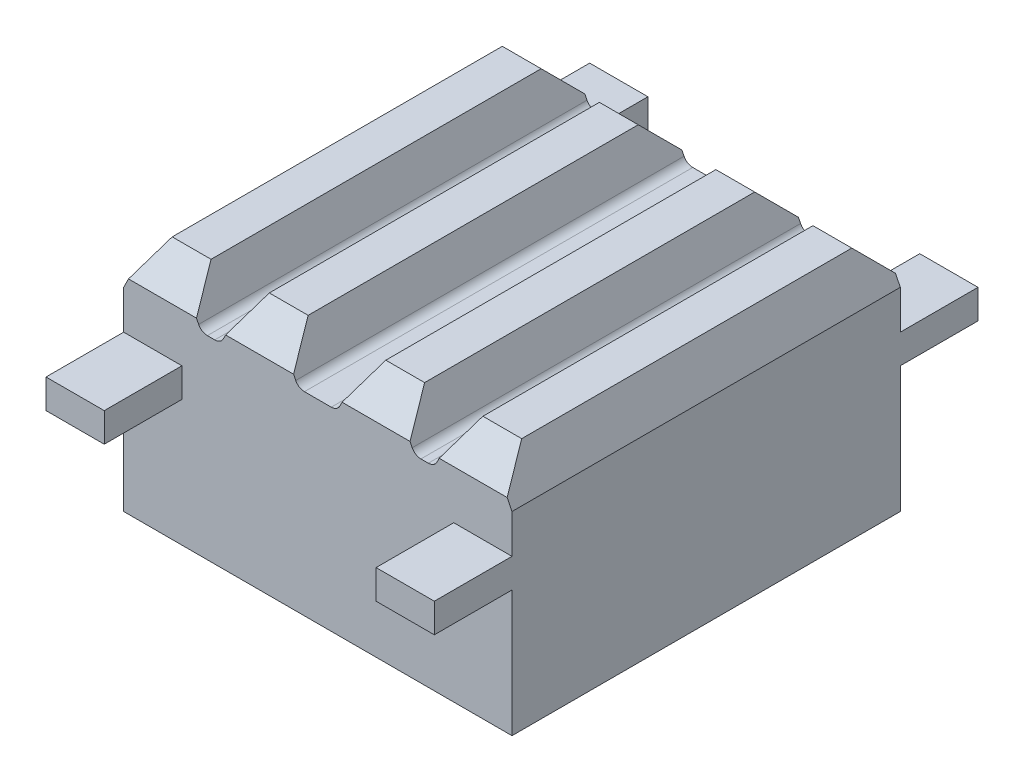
ISO-10303-21;
HEADER;
FILE_DESCRIPTION(('STEP AP214'),'2;1');
FILE_NAME('part.step','',(''),(''),'','','');
FILE_SCHEMA(('AUTOMOTIVE_DESIGN { 1 0 10303 214 1 1 1 1 }'));
ENDSEC;
DATA;
#1=APPLICATION_CONTEXT('core data for automotive mechanical design processes');
#2=APPLICATION_PROTOCOL_DEFINITION('international standard','automotive_design',2000,#1);
#3=PRODUCT_CONTEXT('',#1,'mechanical');
#4=PRODUCT('Part','Part','',(#3));
#5=PRODUCT_RELATED_PRODUCT_CATEGORY('part','',(#4));
#6=PRODUCT_DEFINITION_FORMATION('','',#4);
#7=PRODUCT_DEFINITION_CONTEXT('part definition',#1,'design');
#8=PRODUCT_DEFINITION('design','',#6,#7);
#9=PRODUCT_DEFINITION_SHAPE('','',#8);
#10=(LENGTH_UNIT() NAMED_UNIT(*) SI_UNIT(.MILLI.,.METRE.));
#11=(NAMED_UNIT(*) PLANE_ANGLE_UNIT() SI_UNIT($,.RADIAN.));
#12=(NAMED_UNIT(*) SI_UNIT($,.STERADIAN.) SOLID_ANGLE_UNIT());
#13=UNCERTAINTY_MEASURE_WITH_UNIT(LENGTH_MEASURE(1.E-05),#10,'distance_accuracy_value','');
#14=(GEOMETRIC_REPRESENTATION_CONTEXT(3) GLOBAL_UNCERTAINTY_ASSIGNED_CONTEXT((#13)) GLOBAL_UNIT_ASSIGNED_CONTEXT((#10,
#11,#12)) REPRESENTATION_CONTEXT('',''));
#15=CARTESIAN_POINT('',(0.,0.,0.));
#16=DIRECTION('',(0.,0.,1.));
#17=DIRECTION('',(1.,0.,0.));
#18=AXIS2_PLACEMENT_3D('',#15,#16,#17);
#19=CARTESIAN_POINT('',(0.,12.,0.));
#20=DIRECTION('',(0.,0.,1.));
#21=DIRECTION('',(1.,0.,0.));
#22=AXIS2_PLACEMENT_3D('',#19,#20,#21);
#23=PLANE('',#22);
#24=DIRECTION('',(1.,0.,0.));
#25=VECTOR('',#24,1.);
#26=CARTESIAN_POINT('',(0.,8.00000000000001,0.));
#27=LINE('',#26,#25);
#28=CARTESIAN_POINT('',(0.,8.00000000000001,0.));
#29=VERTEX_POINT('',#28);
#30=CARTESIAN_POINT('',(2.99999999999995,8.00000000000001,0.));
#31=VERTEX_POINT('',#30);
#32=EDGE_CURVE('E425',#29,#31,#27,.T.);
#33=ORIENTED_EDGE('',*,*,#32,.F.);
#34=DIRECTION('',(0.,-1.,0.));
#35=VECTOR('',#34,1.);
#36=CARTESIAN_POINT('',(0.,10.,0.));
#37=LINE('',#36,#35);
#38=CARTESIAN_POINT('',(0.,10.,0.));
#39=VERTEX_POINT('',#38);
#40=EDGE_CURVE('E407',#39,#29,#37,.T.);
#41=ORIENTED_EDGE('',*,*,#40,.F.);
#42=DIRECTION('',(0.447213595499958,0.894427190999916,0.));
#43=VECTOR('',#42,1.);
#44=CARTESIAN_POINT('',(0.,10.,0.));
#45=LINE('',#44,#43);
#46=CARTESIAN_POINT('',(0.249999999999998,10.5,0.));
#47=VERTEX_POINT('',#46);
#48=EDGE_CURVE('E588',#39,#47,#45,.T.);
#49=ORIENTED_EDGE('',*,*,#48,.T.);
#50=DIRECTION('',(1.,0.,0.));
#51=VECTOR('',#50,1.);
#52=CARTESIAN_POINT('',(3.00000000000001,10.5,0.));
#53=LINE('',#52,#51);
#54=CARTESIAN_POINT('',(3.75000000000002,10.5,0.));
#55=VERTEX_POINT('',#54);
#56=EDGE_CURVE('E711',#47,#55,#53,.T.);
#57=ORIENTED_EDGE('',*,*,#56,.T.);
#58=DIRECTION('',(0.447213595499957,-0.894427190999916,0.));
#59=VECTOR('',#58,1.);
#60=CARTESIAN_POINT('',(3.00000000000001,12.,0.));
#61=LINE('',#60,#59);
#62=CARTESIAN_POINT('',(3.861803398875,10.27639320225,0.));
#63=VERTEX_POINT('',#62);
#64=EDGE_CURVE('E585',#55,#63,#61,.T.);
#65=ORIENTED_EDGE('',*,*,#64,.T.);
#66=CARTESIAN_POINT('',(4.30901699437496,10.5,0.));
#67=DIRECTION('',(0.,0.,1.));
#68=DIRECTION('',(1.,0.,0.));
#69=AXIS2_PLACEMENT_3D('',#66,#67,#68);
#70=CIRCLE('',#69,0.5);
#71=CARTESIAN_POINT('',(4.30901699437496,10.,0.));
#72=VERTEX_POINT('',#71);
#73=EDGE_CURVE('E771',#63,#72,#70,.T.);
#74=ORIENTED_EDGE('',*,*,#73,.T.);
#75=DIRECTION('',(1.,0.,0.));
#76=VECTOR('',#75,1.);
#77=CARTESIAN_POINT('',(4.00000000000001,10.,0.));
#78=LINE('',#77,#76);
#79=CARTESIAN_POINT('',(4.69098300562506,10.,0.));
#80=VERTEX_POINT('',#79);
#81=EDGE_CURVE('E582',#72,#80,#78,.T.);
#82=ORIENTED_EDGE('',*,*,#81,.T.);
#83=CARTESIAN_POINT('',(4.69098300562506,10.5,0.));
#84=DIRECTION('',(0.,0.,1.));
#85=DIRECTION('',(1.,0.,0.));
#86=AXIS2_PLACEMENT_3D('',#83,#84,#85);
#87=CIRCLE('',#86,0.5);
#88=CARTESIAN_POINT('',(5.13819660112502,10.27639320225,0.));
#89=VERTEX_POINT('',#88);
#90=EDGE_CURVE('E775',#80,#89,#87,.T.);
#91=ORIENTED_EDGE('',*,*,#90,.T.);
#92=DIRECTION('',(0.447213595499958,0.894427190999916,0.));
#93=VECTOR('',#92,1.);
#94=CARTESIAN_POINT('',(5.00000000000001,10.,0.));
#95=LINE('',#94,#93);
#96=CARTESIAN_POINT('',(5.25,10.5,0.));
#97=VERTEX_POINT('',#96);
#98=EDGE_CURVE('E580',#89,#97,#95,.T.);
#99=ORIENTED_EDGE('',*,*,#98,.T.);
#100=DIRECTION('',(1.,0.,0.));
#101=VECTOR('',#100,1.);
#102=CARTESIAN_POINT('',(8.00000000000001,10.5,0.));
#103=LINE('',#102,#101);
#104=CARTESIAN_POINT('',(8.75000000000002,10.5,0.));
#105=VERTEX_POINT('',#104);
#106=EDGE_CURVE('E708',#97,#105,#103,.T.);
#107=ORIENTED_EDGE('',*,*,#106,.T.);
#108=DIRECTION('',(0.447213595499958,-0.894427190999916,0.));
#109=VECTOR('',#108,1.);
#110=CARTESIAN_POINT('',(8.00000000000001,12.,0.));
#111=LINE('',#110,#109);
#112=CARTESIAN_POINT('',(8.861803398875,10.27639320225,0.));
#113=VERTEX_POINT('',#112);
#114=EDGE_CURVE('E577',#105,#113,#111,.T.);
#115=ORIENTED_EDGE('',*,*,#114,.T.);
#116=CARTESIAN_POINT('',(9.30901699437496,10.5,0.));
#117=DIRECTION('',(0.,0.,1.));
#118=DIRECTION('',(1.,0.,0.));
#119=AXIS2_PLACEMENT_3D('',#116,#117,#118);
#120=CIRCLE('',#119,0.5);
#121=CARTESIAN_POINT('',(9.30901699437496,10.,0.));
#122=VERTEX_POINT('',#121);
#123=EDGE_CURVE('E779',#113,#122,#120,.T.);
#124=ORIENTED_EDGE('',*,*,#123,.T.);
#125=DIRECTION('',(-1.,0.,0.));
#126=VECTOR('',#125,1.);
#127=CARTESIAN_POINT('',(11.,10.,0.));
#128=LINE('',#127,#126);
#129=CARTESIAN_POINT('',(10.6909830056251,10.,0.));
#130=VERTEX_POINT('',#129);
#131=EDGE_CURVE('E574',#130,#122,#128,.T.);
#132=ORIENTED_EDGE('',*,*,#131,.F.);
#133=CARTESIAN_POINT('',(10.6909830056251,10.5,0.));
#134=DIRECTION('',(0.,0.,1.));
#135=DIRECTION('',(1.,0.,0.));
#136=AXIS2_PLACEMENT_3D('',#133,#134,#135);
#137=CIRCLE('',#136,0.5);
#138=CARTESIAN_POINT('',(11.138196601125,10.27639320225,0.));
#139=VERTEX_POINT('',#138);
#140=EDGE_CURVE('E783',#130,#139,#137,.T.);
#141=ORIENTED_EDGE('',*,*,#140,.T.);
#142=DIRECTION('',(-0.447213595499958,-0.894427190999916,0.));
#143=VECTOR('',#142,1.);
#144=CARTESIAN_POINT('',(12.,12.,0.));
#145=LINE('',#144,#143);
#146=CARTESIAN_POINT('',(11.25,10.5,0.));
#147=VERTEX_POINT('',#146);
#148=EDGE_CURVE('E571',#147,#139,#145,.T.);
#149=ORIENTED_EDGE('',*,*,#148,.F.);
#150=DIRECTION('',(1.,0.,0.));
#151=VECTOR('',#150,1.);
#152=CARTESIAN_POINT('',(0.,10.5,0.));
#153=LINE('',#152,#151);
#154=CARTESIAN_POINT('',(14.75,10.5,0.));
#155=VERTEX_POINT('',#154);
#156=EDGE_CURVE('E705',#147,#155,#153,.T.);
#157=ORIENTED_EDGE('',*,*,#156,.T.);
#158=DIRECTION('',(-0.447213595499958,0.894427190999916,0.));
#159=VECTOR('',#158,1.);
#160=CARTESIAN_POINT('',(15.,10.,0.));
#161=LINE('',#160,#159);
#162=CARTESIAN_POINT('',(14.861803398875,10.27639320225,0.));
#163=VERTEX_POINT('',#162);
#164=EDGE_CURVE('E569',#163,#155,#161,.T.);
#165=ORIENTED_EDGE('',*,*,#164,.F.);
#166=CARTESIAN_POINT('',(15.3090169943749,10.5,0.));
#167=DIRECTION('',(0.,0.,1.));
#168=DIRECTION('',(1.,0.,0.));
#169=AXIS2_PLACEMENT_3D('',#166,#167,#168);
#170=CIRCLE('',#169,0.5);
#171=CARTESIAN_POINT('',(15.3090169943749,10.,0.));
#172=VERTEX_POINT('',#171);
#173=EDGE_CURVE('E787',#163,#172,#170,.T.);
#174=ORIENTED_EDGE('',*,*,#173,.T.);
#175=DIRECTION('',(-1.,0.,0.));
#176=VECTOR('',#175,1.);
#177=CARTESIAN_POINT('',(16.,10.,0.));
#178=LINE('',#177,#176);
#179=CARTESIAN_POINT('',(15.6909830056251,10.,0.));
#180=VERTEX_POINT('',#179);
#181=EDGE_CURVE('E566',#180,#172,#178,.T.);
#182=ORIENTED_EDGE('',*,*,#181,.F.);
#183=CARTESIAN_POINT('',(15.6909830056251,10.5,0.));
#184=DIRECTION('',(0.,0.,1.));
#185=DIRECTION('',(1.,0.,0.));
#186=AXIS2_PLACEMENT_3D('',#183,#184,#185);
#187=CIRCLE('',#186,0.5);
#188=CARTESIAN_POINT('',(16.138196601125,10.27639320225,0.));
#189=VERTEX_POINT('',#188);
#190=EDGE_CURVE('E791',#180,#189,#187,.T.);
#191=ORIENTED_EDGE('',*,*,#190,.T.);
#192=DIRECTION('',(-0.447213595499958,-0.894427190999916,0.));
#193=VECTOR('',#192,1.);
#194=CARTESIAN_POINT('',(17.,12.,0.));
#195=LINE('',#194,#193);
#196=CARTESIAN_POINT('',(16.25,10.5,0.));
#197=VERTEX_POINT('',#196);
#198=EDGE_CURVE('E563',#197,#189,#195,.T.);
#199=ORIENTED_EDGE('',*,*,#198,.F.);
#200=DIRECTION('',(1.,0.,0.));
#201=VECTOR('',#200,1.);
#202=CARTESIAN_POINT('',(0.,10.5,0.));
#203=LINE('',#202,#201);
#204=CARTESIAN_POINT('',(19.75,10.5,0.));
#205=VERTEX_POINT('',#204);
#206=EDGE_CURVE('E703',#197,#205,#203,.T.);
#207=ORIENTED_EDGE('',*,*,#206,.T.);
#208=DIRECTION('',(-0.447213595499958,0.894427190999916,0.));
#209=VECTOR('',#208,1.);
#210=CARTESIAN_POINT('',(20.,10.,0.));
#211=LINE('',#210,#209);
#212=CARTESIAN_POINT('',(20.,10.,0.));
#213=VERTEX_POINT('',#212);
#214=EDGE_CURVE('E560',#213,#205,#211,.T.);
#215=ORIENTED_EDGE('',*,*,#214,.F.);
#216=DIRECTION('',(0.,1.,0.));
#217=VECTOR('',#216,1.);
#218=CARTESIAN_POINT('',(20.,0.,0.));
#219=LINE('',#218,#217);
#220=CARTESIAN_POINT('',(20.,8.00000000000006,0.));
#221=VERTEX_POINT('',#220);
#222=EDGE_CURVE('E556',#221,#213,#219,.T.);
#223=ORIENTED_EDGE('',*,*,#222,.F.);
#224=DIRECTION('',(-1.,0.,0.));
#225=VECTOR('',#224,1.);
#226=CARTESIAN_POINT('',(20.,8.00000000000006,0.));
#227=LINE('',#226,#225);
#228=CARTESIAN_POINT('',(17.,8.00000000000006,0.));
#229=VERTEX_POINT('',#228);
#230=EDGE_CURVE('E441',#221,#229,#227,.T.);
#231=ORIENTED_EDGE('',*,*,#230,.T.);
#232=DIRECTION('',(0.,-1.,0.));
#233=VECTOR('',#232,1.);
#234=CARTESIAN_POINT('',(17.,8.00000000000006,0.));
#235=LINE('',#234,#233);
#236=CARTESIAN_POINT('',(17.,6.50000000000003,0.));
#237=VERTEX_POINT('',#236);
#238=EDGE_CURVE('E444',#229,#237,#235,.T.);
#239=ORIENTED_EDGE('',*,*,#238,.T.);
#240=DIRECTION('',(1.,0.,0.));
#241=VECTOR('',#240,1.);
#242=CARTESIAN_POINT('',(17.,6.50000000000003,0.));
#243=LINE('',#242,#241);
#244=CARTESIAN_POINT('',(20.,6.50000000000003,0.));
#245=VERTEX_POINT('',#244);
#246=EDGE_CURVE('E447',#237,#245,#243,.T.);
#247=ORIENTED_EDGE('',*,*,#246,.T.);
#248=CARTESIAN_POINT('',(20.,0.,0.));
#249=VERTEX_POINT('',#248);
#250=EDGE_CURVE('E557',#249,#245,#219,.T.);
#251=ORIENTED_EDGE('',*,*,#250,.F.);
#252=DIRECTION('',(1.,0.,0.));
#253=VECTOR('',#252,1.);
#254=CARTESIAN_POINT('',(0.,0.,0.));
#255=LINE('',#254,#253);
#256=CARTESIAN_POINT('',(0.,0.,0.));
#257=VERTEX_POINT('',#256);
#258=EDGE_CURVE('E403',#257,#249,#255,.T.);
#259=ORIENTED_EDGE('',*,*,#258,.F.);
#260=CARTESIAN_POINT('',(0.,6.49999999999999,0.));
#261=VERTEX_POINT('',#260);
#262=EDGE_CURVE('E399',#261,#257,#37,.T.);
#263=ORIENTED_EDGE('',*,*,#262,.F.);
#264=DIRECTION('',(-1.,0.,0.));
#265=VECTOR('',#264,1.);
#266=CARTESIAN_POINT('',(3.,6.50000000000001,0.));
#267=LINE('',#266,#265);
#268=CARTESIAN_POINT('',(3.,6.50000000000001,0.));
#269=VERTEX_POINT('',#268);
#270=EDGE_CURVE('E46',#269,#261,#267,.T.);
#271=ORIENTED_EDGE('',*,*,#270,.F.);
#272=DIRECTION('',(0.,-1.,0.));
#273=VECTOR('',#272,1.);
#274=CARTESIAN_POINT('',(2.99999999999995,8.00000000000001,0.));
#275=LINE('',#274,#273);
#276=EDGE_CURVE('E41',#31,#269,#275,.T.);
#277=ORIENTED_EDGE('',*,*,#276,.F.);
#278=EDGE_LOOP('',(#33,#41,#49,#57,#65,#74,#82,#91,#99,#107,#115,#124,#132,#141,#149,#157,#165,
#174,#182,#191,#199,#207,#215,#223,#231,#239,#247,#251,#259,#263,#271,#277));
#279=FACE_BOUND('',#278,.T.);
#280=ADVANCED_FACE('F26',(#279),#23,.F.);
#281=CARTESIAN_POINT('',(0.,12.,20.));
#282=DIRECTION('',(0.,0.,1.));
#283=DIRECTION('',(1.,0.,0.));
#284=AXIS2_PLACEMENT_3D('',#281,#282,#283);
#285=PLANE('',#284);
#286=DIRECTION('',(0.,1.,0.));
#287=VECTOR('',#286,1.);
#288=CARTESIAN_POINT('',(17.,6.50000000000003,20.));
#289=LINE('',#288,#287);
#290=CARTESIAN_POINT('',(17.,6.50000000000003,20.));
#291=VERTEX_POINT('',#290);
#292=CARTESIAN_POINT('',(17.,8.00000000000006,20.));
#293=VERTEX_POINT('',#292);
#294=EDGE_CURVE('E474',#291,#293,#289,.T.);
#295=ORIENTED_EDGE('',*,*,#294,.T.);
#296=DIRECTION('',(-1.,0.,0.));
#297=VECTOR('',#296,1.);
#298=CARTESIAN_POINT('',(20.,8.00000000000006,20.));
#299=LINE('',#298,#297);
#300=CARTESIAN_POINT('',(20.,8.00000000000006,20.));
#301=VERTEX_POINT('',#300);
#302=EDGE_CURVE('E477',#301,#293,#299,.T.);
#303=ORIENTED_EDGE('',*,*,#302,.F.);
#304=DIRECTION('',(0.,1.,0.));
#305=VECTOR('',#304,1.);
#306=CARTESIAN_POINT('',(20.,0.,20.));
#307=LINE('',#306,#305);
#308=CARTESIAN_POINT('',(20.,10.,20.));
#309=VERTEX_POINT('',#308);
#310=EDGE_CURVE('E597',#301,#309,#307,.T.);
#311=ORIENTED_EDGE('',*,*,#310,.T.);
#312=DIRECTION('',(-0.447213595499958,0.894427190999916,0.));
#313=VECTOR('',#312,1.);
#314=CARTESIAN_POINT('',(20.,10.,20.));
#315=LINE('',#314,#313);
#316=CARTESIAN_POINT('',(19.75,10.5,20.));
#317=VERTEX_POINT('',#316);
#318=EDGE_CURVE('E601',#309,#317,#315,.T.);
#319=ORIENTED_EDGE('',*,*,#318,.T.);
#320=DIRECTION('',(-1.,0.,0.));
#321=VECTOR('',#320,1.);
#322=CARTESIAN_POINT('',(17.,10.5,20.));
#323=LINE('',#322,#321);
#324=CARTESIAN_POINT('',(16.25,10.5,20.));
#325=VERTEX_POINT('',#324);
#326=EDGE_CURVE('E670',#317,#325,#323,.T.);
#327=ORIENTED_EDGE('',*,*,#326,.T.);
#328=DIRECTION('',(-0.447213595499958,-0.894427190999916,0.));
#329=VECTOR('',#328,1.);
#330=CARTESIAN_POINT('',(17.,12.,20.));
#331=LINE('',#330,#329);
#332=CARTESIAN_POINT('',(16.138196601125,10.27639320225,20.));
#333=VERTEX_POINT('',#332);
#334=EDGE_CURVE('E604',#325,#333,#331,.T.);
#335=ORIENTED_EDGE('',*,*,#334,.T.);
#336=CARTESIAN_POINT('',(15.6909830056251,10.5,20.));
#337=DIRECTION('',(0.,0.,1.));
#338=DIRECTION('',(1.,0.,0.));
#339=AXIS2_PLACEMENT_3D('',#336,#337,#338);
#340=CIRCLE('',#339,0.5);
#341=CARTESIAN_POINT('',(15.6909830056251,10.,20.));
#342=VERTEX_POINT('',#341);
#343=EDGE_CURVE('E793',#333,#342,#340,.F.);
#344=ORIENTED_EDGE('',*,*,#343,.T.);
#345=DIRECTION('',(-1.,0.,0.));
#346=VECTOR('',#345,1.);
#347=CARTESIAN_POINT('',(16.,10.,20.));
#348=LINE('',#347,#346);
#349=CARTESIAN_POINT('',(15.3090169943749,10.,20.));
#350=VERTEX_POINT('',#349);
#351=EDGE_CURVE('E607',#342,#350,#348,.T.);
#352=ORIENTED_EDGE('',*,*,#351,.T.);
#353=CARTESIAN_POINT('',(15.3090169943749,10.5,20.));
#354=DIRECTION('',(0.,0.,1.));
#355=DIRECTION('',(1.,0.,0.));
#356=AXIS2_PLACEMENT_3D('',#353,#354,#355);
#357=CIRCLE('',#356,0.5);
#358=CARTESIAN_POINT('',(14.861803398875,10.27639320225,20.));
#359=VERTEX_POINT('',#358);
#360=EDGE_CURVE('E789',#350,#359,#357,.F.);
#361=ORIENTED_EDGE('',*,*,#360,.T.);
#362=DIRECTION('',(-0.447213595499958,0.894427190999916,0.));
#363=VECTOR('',#362,1.);
#364=CARTESIAN_POINT('',(15.,10.,20.));
#365=LINE('',#364,#363);
#366=CARTESIAN_POINT('',(14.75,10.5,20.));
#367=VERTEX_POINT('',#366);
#368=EDGE_CURVE('E610',#359,#367,#365,.T.);
#369=ORIENTED_EDGE('',*,*,#368,.T.);
#370=DIRECTION('',(-1.,0.,0.));
#371=VECTOR('',#370,1.);
#372=CARTESIAN_POINT('',(12.,10.5,20.));
#373=LINE('',#372,#371);
#374=CARTESIAN_POINT('',(11.25,10.5,20.));
#375=VERTEX_POINT('',#374);
#376=EDGE_CURVE('E673',#367,#375,#373,.T.);
#377=ORIENTED_EDGE('',*,*,#376,.T.);
#378=DIRECTION('',(-0.447213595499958,-0.894427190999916,0.));
#379=VECTOR('',#378,1.);
#380=CARTESIAN_POINT('',(12.,12.,20.));
#381=LINE('',#380,#379);
#382=CARTESIAN_POINT('',(11.138196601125,10.27639320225,20.));
#383=VERTEX_POINT('',#382);
#384=EDGE_CURVE('E612',#375,#383,#381,.T.);
#385=ORIENTED_EDGE('',*,*,#384,.T.);
#386=CARTESIAN_POINT('',(10.6909830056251,10.5,20.));
#387=DIRECTION('',(0.,0.,1.));
#388=DIRECTION('',(1.,0.,0.));
#389=AXIS2_PLACEMENT_3D('',#386,#387,#388);
#390=CIRCLE('',#389,0.5);
#391=CARTESIAN_POINT('',(10.6909830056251,10.,20.));
#392=VERTEX_POINT('',#391);
#393=EDGE_CURVE('E785',#383,#392,#390,.F.);
#394=ORIENTED_EDGE('',*,*,#393,.T.);
#395=DIRECTION('',(-1.,0.,0.));
#396=VECTOR('',#395,1.);
#397=CARTESIAN_POINT('',(11.,10.,20.));
#398=LINE('',#397,#396);
#399=CARTESIAN_POINT('',(9.30901699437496,10.,20.));
#400=VERTEX_POINT('',#399);
#401=EDGE_CURVE('E615',#392,#400,#398,.T.);
#402=ORIENTED_EDGE('',*,*,#401,.T.);
#403=CARTESIAN_POINT('',(9.30901699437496,10.5,20.));
#404=DIRECTION('',(0.,0.,1.));
#405=DIRECTION('',(1.,0.,0.));
#406=AXIS2_PLACEMENT_3D('',#403,#404,#405);
#407=CIRCLE('',#406,0.5);
#408=CARTESIAN_POINT('',(8.861803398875,10.27639320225,20.));
#409=VERTEX_POINT('',#408);
#410=EDGE_CURVE('E781',#400,#409,#407,.F.);
#411=ORIENTED_EDGE('',*,*,#410,.T.);
#412=DIRECTION('',(0.447213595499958,-0.894427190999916,0.));
#413=VECTOR('',#412,1.);
#414=CARTESIAN_POINT('',(8.00000000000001,12.,20.));
#415=LINE('',#414,#413);
#416=CARTESIAN_POINT('',(8.75000000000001,10.5,20.));
#417=VERTEX_POINT('',#416);
#418=EDGE_CURVE('E618',#417,#409,#415,.T.);
#419=ORIENTED_EDGE('',*,*,#418,.F.);
#420=DIRECTION('',(-1.,0.,0.));
#421=VECTOR('',#420,1.);
#422=CARTESIAN_POINT('',(0.,10.5,20.));
#423=LINE('',#422,#421);
#424=CARTESIAN_POINT('',(5.25,10.5,20.));
#425=VERTEX_POINT('',#424);
#426=EDGE_CURVE('E676',#417,#425,#423,.T.);
#427=ORIENTED_EDGE('',*,*,#426,.T.);
#428=DIRECTION('',(0.447213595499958,0.894427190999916,0.));
#429=VECTOR('',#428,1.);
#430=CARTESIAN_POINT('',(5.00000000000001,10.,20.));
#431=LINE('',#430,#429);
#432=CARTESIAN_POINT('',(5.13819660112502,10.27639320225,20.));
#433=VERTEX_POINT('',#432);
#434=EDGE_CURVE('E621',#433,#425,#431,.T.);
#435=ORIENTED_EDGE('',*,*,#434,.F.);
#436=CARTESIAN_POINT('',(4.69098300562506,10.5,20.));
#437=DIRECTION('',(0.,0.,1.));
#438=DIRECTION('',(1.,0.,0.));
#439=AXIS2_PLACEMENT_3D('',#436,#437,#438);
#440=CIRCLE('',#439,0.5);
#441=CARTESIAN_POINT('',(4.69098300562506,10.,20.));
#442=VERTEX_POINT('',#441);
#443=EDGE_CURVE('E777',#433,#442,#440,.F.);
#444=ORIENTED_EDGE('',*,*,#443,.T.);
#445=DIRECTION('',(1.,0.,0.));
#446=VECTOR('',#445,1.);
#447=CARTESIAN_POINT('',(4.00000000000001,10.,20.));
#448=LINE('',#447,#446);
#449=CARTESIAN_POINT('',(4.30901699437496,10.,20.));
#450=VERTEX_POINT('',#449);
#451=EDGE_CURVE('E623',#450,#442,#448,.T.);
#452=ORIENTED_EDGE('',*,*,#451,.F.);
#453=CARTESIAN_POINT('',(4.30901699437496,10.5,20.));
#454=DIRECTION('',(0.,0.,1.));
#455=DIRECTION('',(1.,0.,0.));
#456=AXIS2_PLACEMENT_3D('',#453,#454,#455);
#457=CIRCLE('',#456,0.5);
#458=CARTESIAN_POINT('',(3.861803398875,10.27639320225,20.));
#459=VERTEX_POINT('',#458);
#460=EDGE_CURVE('E773',#450,#459,#457,.F.);
#461=ORIENTED_EDGE('',*,*,#460,.T.);
#462=DIRECTION('',(0.447213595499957,-0.894427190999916,0.));
#463=VECTOR('',#462,1.);
#464=CARTESIAN_POINT('',(3.00000000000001,12.,20.));
#465=LINE('',#464,#463);
#466=CARTESIAN_POINT('',(3.75000000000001,10.5,20.));
#467=VERTEX_POINT('',#466);
#468=EDGE_CURVE('E626',#467,#459,#465,.T.);
#469=ORIENTED_EDGE('',*,*,#468,.F.);
#470=DIRECTION('',(-1.,0.,0.));
#471=VECTOR('',#470,1.);
#472=CARTESIAN_POINT('',(0.,10.5,20.));
#473=LINE('',#472,#471);
#474=CARTESIAN_POINT('',(0.250000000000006,10.5,20.));
#475=VERTEX_POINT('',#474);
#476=EDGE_CURVE('E679',#467,#475,#473,.T.);
#477=ORIENTED_EDGE('',*,*,#476,.T.);
#478=DIRECTION('',(0.447213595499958,0.894427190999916,0.));
#479=VECTOR('',#478,1.);
#480=CARTESIAN_POINT('',(0.,10.,20.));
#481=LINE('',#480,#479);
#482=CARTESIAN_POINT('',(0.,10.,20.));
#483=VERTEX_POINT('',#482);
#484=EDGE_CURVE('E629',#483,#475,#481,.T.);
#485=ORIENTED_EDGE('',*,*,#484,.F.);
#486=DIRECTION('',(0.,-1.,0.));
#487=VECTOR('',#486,1.);
#488=CARTESIAN_POINT('',(0.,10.,20.));
#489=LINE('',#488,#487);
#490=CARTESIAN_POINT('',(0.,8.00000000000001,20.));
#491=VERTEX_POINT('',#490);
#492=EDGE_CURVE('E592',#483,#491,#489,.T.);
#493=ORIENTED_EDGE('',*,*,#492,.T.);
#494=DIRECTION('',(1.,0.,0.));
#495=VECTOR('',#494,1.);
#496=CARTESIAN_POINT('',(0.,8.00000000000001,20.));
#497=LINE('',#496,#495);
#498=CARTESIAN_POINT('',(2.99999999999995,8.00000000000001,20.));
#499=VERTEX_POINT('',#498);
#500=EDGE_CURVE('E501',#491,#499,#497,.T.);
#501=ORIENTED_EDGE('',*,*,#500,.T.);
#502=DIRECTION('',(0.,-1.,0.));
#503=VECTOR('',#502,1.);
#504=CARTESIAN_POINT('',(2.99999999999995,8.00000000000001,20.));
#505=LINE('',#504,#503);
#506=CARTESIAN_POINT('',(3.,6.50000000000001,20.));
#507=VERTEX_POINT('',#506);
#508=EDGE_CURVE('E503',#499,#507,#505,.T.);
#509=ORIENTED_EDGE('',*,*,#508,.T.);
#510=DIRECTION('',(-1.,0.,0.));
#511=VECTOR('',#510,1.);
#512=CARTESIAN_POINT('',(3.,6.50000000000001,20.));
#513=LINE('',#512,#511);
#514=CARTESIAN_POINT('',(0.,6.49999999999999,20.));
#515=VERTEX_POINT('',#514);
#516=EDGE_CURVE('E505',#507,#515,#513,.T.);
#517=ORIENTED_EDGE('',*,*,#516,.T.);
#518=CARTESIAN_POINT('',(0.,0.,20.));
#519=VERTEX_POINT('',#518);
#520=EDGE_CURVE('E591',#515,#519,#489,.T.);
#521=ORIENTED_EDGE('',*,*,#520,.T.);
#522=DIRECTION('',(1.,0.,0.));
#523=VECTOR('',#522,1.);
#524=CARTESIAN_POINT('',(0.,0.,20.));
#525=LINE('',#524,#523);
#526=CARTESIAN_POINT('',(20.,0.,20.));
#527=VERTEX_POINT('',#526);
#528=EDGE_CURVE('E594',#519,#527,#525,.T.);
#529=ORIENTED_EDGE('',*,*,#528,.T.);
#530=CARTESIAN_POINT('',(20.,6.50000000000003,20.));
#531=VERTEX_POINT('',#530);
#532=EDGE_CURVE('E598',#527,#531,#307,.T.);
#533=ORIENTED_EDGE('',*,*,#532,.T.);
#534=DIRECTION('',(1.,0.,0.));
#535=VECTOR('',#534,1.);
#536=CARTESIAN_POINT('',(17.,6.50000000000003,20.));
#537=LINE('',#536,#535);
#538=EDGE_CURVE('E471',#291,#531,#537,.T.);
#539=ORIENTED_EDGE('',*,*,#538,.F.);
#540=EDGE_LOOP('',(#295,#303,#311,#319,#327,#335,#344,#352,#361,#369,#377,#385,#394,#402,#411,
#419,#427,#435,#444,#452,#461,#469,#477,#485,#493,#501,#509,#517,#521,#529,#533,#539));
#541=FACE_BOUND('',#540,.T.);
#542=ADVANCED_FACE('F921',(#541),#285,.T.);
#543=CARTESIAN_POINT('',(18.,4.,2.));
#544=DIRECTION('',(1.,0.,0.));
#545=DIRECTION('',(0.,0.,-1.));
#546=AXIS2_PLACEMENT_3D('',#543,#544,#545);
#547=PLANE('',#546);
#548=DIRECTION('',(0.,0.,1.));
#549=VECTOR('',#548,1.);
#550=CARTESIAN_POINT('',(18.,4.,2.));
#551=LINE('',#550,#549);
#552=CARTESIAN_POINT('',(18.,4.,3.5));
#553=VERTEX_POINT('',#552);
#554=CARTESIAN_POINT('',(18.,4.,16.5));
#555=VERTEX_POINT('',#554);
#556=EDGE_CURVE('E543',#553,#555,#551,.T.);
#557=ORIENTED_EDGE('',*,*,#556,.F.);
#558=DIRECTION('',(0.,-1.,0.));
#559=VECTOR('',#558,1.);
#560=CARTESIAN_POINT('',(18.,4.,3.5));
#561=LINE('',#560,#559);
#562=CARTESIAN_POINT('',(18.,0.,3.5));
#563=VERTEX_POINT('',#562);
#564=EDGE_CURVE('E849',#553,#563,#561,.T.);
#565=ORIENTED_EDGE('',*,*,#564,.T.);
#566=DIRECTION('',(0.,0.,1.));
#567=VECTOR('',#566,1.);
#568=CARTESIAN_POINT('',(18.,0.,2.));
#569=LINE('',#568,#567);
#570=CARTESIAN_POINT('',(18.,0.,16.5));
#571=VERTEX_POINT('',#570);
#572=EDGE_CURVE('E531',#563,#571,#569,.T.);
#573=ORIENTED_EDGE('',*,*,#572,.T.);
#574=DIRECTION('',(0.,-1.,0.));
#575=VECTOR('',#574,1.);
#576=CARTESIAN_POINT('',(18.,4.,16.5));
#577=LINE('',#576,#575);
#578=EDGE_CURVE('E829',#571,#555,#577,.F.);
#579=ORIENTED_EDGE('',*,*,#578,.T.);
#580=EDGE_LOOP('',(#557,#565,#573,#579));
#581=FACE_BOUND('',#580,.T.);
#582=ADVANCED_FACE('F907',(#581),#547,.F.);
#583=CARTESIAN_POINT('',(18.,4.,2.));
#584=DIRECTION('',(0.,0.,1.));
#585=DIRECTION('',(1.,0.,0.));
#586=AXIS2_PLACEMENT_3D('',#583,#584,#585);
#587=PLANE('',#586);
#588=DIRECTION('',(-1.,0.,0.));
#589=VECTOR('',#588,1.);
#590=CARTESIAN_POINT('',(18.,0.,2.));
#591=LINE('',#590,#589);
#592=CARTESIAN_POINT('',(16.5,0.,2.));
#593=VERTEX_POINT('',#592);
#594=CARTESIAN_POINT('',(15.5,0.,2.));
#595=VERTEX_POINT('',#594);
#596=EDGE_CURVE('E541',#593,#595,#591,.T.);
#597=ORIENTED_EDGE('',*,*,#596,.F.);
#598=DIRECTION('',(0.,-1.,0.));
#599=VECTOR('',#598,1.);
#600=CARTESIAN_POINT('',(16.5,4.,2.));
#601=LINE('',#600,#599);
#602=CARTESIAN_POINT('',(16.5,4.,2.));
#603=VERTEX_POINT('',#602);
#604=EDGE_CURVE('E852',#593,#603,#601,.F.);
#605=ORIENTED_EDGE('',*,*,#604,.T.);
#606=DIRECTION('',(-1.,0.,0.));
#607=VECTOR('',#606,1.);
#608=CARTESIAN_POINT('',(18.,4.,2.));
#609=LINE('',#608,#607);
#610=CARTESIAN_POINT('',(15.5,4.,2.));
#611=VERTEX_POINT('',#610);
#612=EDGE_CURVE('E408',#603,#611,#609,.T.);
#613=ORIENTED_EDGE('',*,*,#612,.T.);
#614=DIRECTION('',(0.,-1.,0.));
#615=VECTOR('',#614,1.);
#616=CARTESIAN_POINT('',(15.5,4.,2.));
#617=LINE('',#616,#615);
#618=EDGE_CURVE('E795',#611,#595,#617,.T.);
#619=ORIENTED_EDGE('',*,*,#618,.T.);
#620=EDGE_LOOP('',(#597,#605,#613,#619));
#621=FACE_BOUND('',#620,.T.);
#622=ADVANCED_FACE('F1433',(#621),#587,.T.);
#623=CARTESIAN_POINT('',(14.,4.,14.));
#624=DIRECTION('',(-1.,0.,0.));
#625=DIRECTION('',(0.,0.,1.));
#626=AXIS2_PLACEMENT_3D('',#623,#624,#625);
#627=PLANE('',#626);
#628=DIRECTION('',(0.,0.,-1.));
#629=VECTOR('',#628,1.);
#630=CARTESIAN_POINT('',(14.,4.,14.));
#631=LINE('',#630,#629);
#632=CARTESIAN_POINT('',(14.,4.,12.5));
#633=VERTEX_POINT('',#632);
#634=CARTESIAN_POINT('',(14.,4.,3.5));
#635=VERTEX_POINT('',#634);
#636=EDGE_CURVE('E551',#633,#635,#631,.T.);
#637=ORIENTED_EDGE('',*,*,#636,.F.);
#638=DIRECTION('',(0.,-1.,0.));
#639=VECTOR('',#638,1.);
#640=CARTESIAN_POINT('',(14.,4.,12.5));
#641=LINE('',#640,#639);
#642=CARTESIAN_POINT('',(14.,0.,12.5));
#643=VERTEX_POINT('',#642);
#644=EDGE_CURVE('E819',#633,#643,#641,.T.);
#645=ORIENTED_EDGE('',*,*,#644,.T.);
#646=DIRECTION('',(0.,0.,-1.));
#647=VECTOR('',#646,1.);
#648=CARTESIAN_POINT('',(14.,0.,14.));
#649=LINE('',#648,#647);
#650=CARTESIAN_POINT('',(14.,0.,3.5));
#651=VERTEX_POINT('',#650);
#652=EDGE_CURVE('E539',#643,#651,#649,.T.);
#653=ORIENTED_EDGE('',*,*,#652,.T.);
#654=DIRECTION('',(0.,-1.,0.));
#655=VECTOR('',#654,1.);
#656=CARTESIAN_POINT('',(14.,4.,3.5));
#657=LINE('',#656,#655);
#658=EDGE_CURVE('E798',#651,#635,#657,.F.);
#659=ORIENTED_EDGE('',*,*,#658,.T.);
#660=EDGE_LOOP('',(#637,#645,#653,#659));
#661=FACE_BOUND('',#660,.T.);
#662=ADVANCED_FACE('F888',(#661),#627,.F.);
#663=CARTESIAN_POINT('',(14.,4.,14.));
#664=DIRECTION('',(0.,0.,1.));
#665=DIRECTION('',(1.,0.,0.));
#666=AXIS2_PLACEMENT_3D('',#663,#664,#665);
#667=PLANE('',#666);
#668=DIRECTION('',(-1.,0.,0.));
#669=VECTOR('',#668,1.);
#670=CARTESIAN_POINT('',(14.,0.,14.));
#671=LINE('',#670,#669);
#672=CARTESIAN_POINT('',(12.5,0.,14.));
#673=VERTEX_POINT('',#672);
#674=CARTESIAN_POINT('',(3.5,0.,14.));
#675=VERTEX_POINT('',#674);
#676=EDGE_CURVE('E537',#673,#675,#671,.T.);
#677=ORIENTED_EDGE('',*,*,#676,.F.);
#678=DIRECTION('',(0.,-1.,0.));
#679=VECTOR('',#678,1.);
#680=CARTESIAN_POINT('',(12.5,4.,14.));
#681=LINE('',#680,#679);
#682=CARTESIAN_POINT('',(12.5,4.,14.));
#683=VERTEX_POINT('',#682);
#684=EDGE_CURVE('E824',#673,#683,#681,.F.);
#685=ORIENTED_EDGE('',*,*,#684,.T.);
#686=DIRECTION('',(-1.,0.,0.));
#687=VECTOR('',#686,1.);
#688=CARTESIAN_POINT('',(14.,4.,14.));
#689=LINE('',#688,#687);
#690=CARTESIAN_POINT('',(3.5,4.,14.));
#691=VERTEX_POINT('',#690);
#692=EDGE_CURVE('E549',#683,#691,#689,.T.);
#693=ORIENTED_EDGE('',*,*,#692,.T.);
#694=DIRECTION('',(0.,-1.,0.));
#695=VECTOR('',#694,1.);
#696=CARTESIAN_POINT('',(3.5,4.,14.));
#697=LINE('',#696,#695);
#698=EDGE_CURVE('E807',#691,#675,#697,.T.);
#699=ORIENTED_EDGE('',*,*,#698,.T.);
#700=EDGE_LOOP('',(#677,#685,#693,#699));
#701=FACE_BOUND('',#700,.T.);
#702=ADVANCED_FACE('F1446',(#701),#667,.T.);
#703=CARTESIAN_POINT('',(2.,4.,18.));
#704=DIRECTION('',(-1.,0.,0.));
#705=DIRECTION('',(0.,0.,1.));
#706=AXIS2_PLACEMENT_3D('',#703,#704,#705);
#707=PLANE('',#706);
#708=DIRECTION('',(0.,0.,-1.));
#709=VECTOR('',#708,1.);
#710=CARTESIAN_POINT('',(2.,4.,18.));
#711=LINE('',#710,#709);
#712=CARTESIAN_POINT('',(2.,4.,16.5));
#713=VERTEX_POINT('',#712);
#714=CARTESIAN_POINT('',(2.,4.,15.5));
#715=VERTEX_POINT('',#714);
#716=EDGE_CURVE('E547',#713,#715,#711,.T.);
#717=ORIENTED_EDGE('',*,*,#716,.F.);
#718=DIRECTION('',(0.,-1.,0.));
#719=VECTOR('',#718,1.);
#720=CARTESIAN_POINT('',(2.,4.,16.5));
#721=LINE('',#720,#719);
#722=CARTESIAN_POINT('',(2.,0.,16.5));
#723=VERTEX_POINT('',#722);
#724=EDGE_CURVE('E840',#713,#723,#721,.T.);
#725=ORIENTED_EDGE('',*,*,#724,.T.);
#726=DIRECTION('',(0.,0.,-1.));
#727=VECTOR('',#726,1.);
#728=CARTESIAN_POINT('',(2.,0.,18.));
#729=LINE('',#728,#727);
#730=CARTESIAN_POINT('',(2.,0.,15.5));
#731=VERTEX_POINT('',#730);
#732=EDGE_CURVE('E535',#723,#731,#729,.T.);
#733=ORIENTED_EDGE('',*,*,#732,.T.);
#734=DIRECTION('',(0.,-1.,0.));
#735=VECTOR('',#734,1.);
#736=CARTESIAN_POINT('',(2.,4.,15.5));
#737=LINE('',#736,#735);
#738=EDGE_CURVE('E810',#731,#715,#737,.F.);
#739=ORIENTED_EDGE('',*,*,#738,.T.);
#740=EDGE_LOOP('',(#717,#725,#733,#739));
#741=FACE_BOUND('',#740,.T.);
#742=ADVANCED_FACE('F872',(#741),#707,.F.);
#743=CARTESIAN_POINT('',(14.,4.,18.));
#744=DIRECTION('',(0.,0.,-1.));
#745=DIRECTION('',(-1.,0.,0.));
#746=AXIS2_PLACEMENT_3D('',#743,#744,#745);
#747=PLANE('',#746);
#748=DIRECTION('',(1.,0.,0.));
#749=VECTOR('',#748,1.);
#750=CARTESIAN_POINT('',(2.,0.,18.));
#751=LINE('',#750,#749);
#752=CARTESIAN_POINT('',(3.5,0.,18.));
#753=VERTEX_POINT('',#752);
#754=CARTESIAN_POINT('',(16.5,0.,18.));
#755=VERTEX_POINT('',#754);
#756=EDGE_CURVE('E533',#753,#755,#751,.T.);
#757=ORIENTED_EDGE('',*,*,#756,.F.);
#758=DIRECTION('',(0.,-1.,0.));
#759=VECTOR('',#758,1.);
#760=CARTESIAN_POINT('',(3.5,4.,18.));
#761=LINE('',#760,#759);
#762=CARTESIAN_POINT('',(3.5,4.,18.));
#763=VERTEX_POINT('',#762);
#764=EDGE_CURVE('E843',#753,#763,#761,.F.);
#765=ORIENTED_EDGE('',*,*,#764,.T.);
#766=DIRECTION('',(1.,0.,0.));
#767=VECTOR('',#766,1.);
#768=CARTESIAN_POINT('',(14.,4.,18.));
#769=LINE('',#768,#767);
#770=CARTESIAN_POINT('',(16.5,4.,18.));
#771=VERTEX_POINT('',#770);
#772=EDGE_CURVE('E545',#763,#771,#769,.T.);
#773=ORIENTED_EDGE('',*,*,#772,.T.);
#774=DIRECTION('',(0.,-1.,0.));
#775=VECTOR('',#774,1.);
#776=CARTESIAN_POINT('',(16.5,4.,18.));
#777=LINE('',#776,#775);
#778=EDGE_CURVE('E826',#771,#755,#777,.T.);
#779=ORIENTED_EDGE('',*,*,#778,.T.);
#780=EDGE_LOOP('',(#757,#765,#773,#779));
#781=FACE_BOUND('',#780,.T.);
#782=ADVANCED_FACE('F863',(#781),#747,.T.);
#783=CARTESIAN_POINT('',(18.,4.,18.));
#784=DIRECTION('',(0.,1.,0.));
#785=DIRECTION('',(0.,0.,1.));
#786=AXIS2_PLACEMENT_3D('',#783,#784,#785);
#787=PLANE('',#786);
#788=ORIENTED_EDGE('',*,*,#772,.F.);
#789=CARTESIAN_POINT('',(3.5,4.,16.5));
#790=DIRECTION('',(0.,1.,0.));
#791=DIRECTION('',(0.,0.,1.));
#792=AXIS2_PLACEMENT_3D('',#789,#790,#791);
#793=CIRCLE('',#792,1.5);
#794=EDGE_CURVE('E847',#763,#713,#793,.F.);
#795=ORIENTED_EDGE('',*,*,#794,.T.);
#796=ORIENTED_EDGE('',*,*,#716,.T.);
#797=CARTESIAN_POINT('',(3.5,4.,15.5));
#798=DIRECTION('',(0.,1.,0.));
#799=DIRECTION('',(0.,0.,1.));
#800=AXIS2_PLACEMENT_3D('',#797,#798,#799);
#801=CIRCLE('',#800,1.5);
#802=EDGE_CURVE('E801',#715,#691,#801,.F.);
#803=ORIENTED_EDGE('',*,*,#802,.T.);
#804=ORIENTED_EDGE('',*,*,#692,.F.);
#805=CARTESIAN_POINT('',(12.5,4.,12.5));
#806=DIRECTION('',(0.,1.,0.));
#807=DIRECTION('',(0.,0.,1.));
#808=AXIS2_PLACEMENT_3D('',#805,#806,#807);
#809=CIRCLE('',#808,1.5);
#810=EDGE_CURVE('E835',#683,#633,#809,.T.);
#811=ORIENTED_EDGE('',*,*,#810,.T.);
#812=ORIENTED_EDGE('',*,*,#636,.T.);
#813=CARTESIAN_POINT('',(15.5,4.,3.5));
#814=DIRECTION('',(0.,1.,0.));
#815=DIRECTION('',(0.,0.,1.));
#816=AXIS2_PLACEMENT_3D('',#813,#814,#815);
#817=CIRCLE('',#816,1.5);
#818=EDGE_CURVE('E804',#635,#611,#817,.F.);
#819=ORIENTED_EDGE('',*,*,#818,.T.);
#820=ORIENTED_EDGE('',*,*,#612,.F.);
#821=CARTESIAN_POINT('',(16.5,4.,3.5));
#822=DIRECTION('',(0.,1.,0.));
#823=DIRECTION('',(0.,0.,1.));
#824=AXIS2_PLACEMENT_3D('',#821,#822,#823);
#825=CIRCLE('',#824,1.5);
#826=EDGE_CURVE('E845',#603,#553,#825,.F.);
#827=ORIENTED_EDGE('',*,*,#826,.T.);
#828=ORIENTED_EDGE('',*,*,#556,.T.);
#829=CARTESIAN_POINT('',(16.5,4.,16.5));
#830=DIRECTION('',(0.,1.,0.));
#831=DIRECTION('',(0.,0.,1.));
#832=AXIS2_PLACEMENT_3D('',#829,#830,#831);
#833=CIRCLE('',#832,1.5);
#834=EDGE_CURVE('E832',#555,#771,#833,.F.);
#835=ORIENTED_EDGE('',*,*,#834,.T.);
#836=EDGE_LOOP('',(#788,#795,#796,#803,#804,#811,#812,#819,#820,#827,#828,#835));
#837=FACE_BOUND('',#836,.T.);
#838=ADVANCED_FACE('F870',(#837),#787,.F.);
#839=CARTESIAN_POINT('',(0.,10.,20.));
#840=DIRECTION('',(1.,0.,0.));
#841=DIRECTION('',(0.,1.,0.));
#842=AXIS2_PLACEMENT_3D('',#839,#840,#841);
#843=PLANE('',#842);
#844=DIRECTION('',(0.,0.,-1.));
#845=VECTOR('',#844,1.);
#846=CARTESIAN_POINT('',(0.,0.,20.));
#847=LINE('',#846,#845);
#848=EDGE_CURVE('E663',#519,#257,#847,.T.);
#849=ORIENTED_EDGE('',*,*,#848,.F.);
#850=ORIENTED_EDGE('',*,*,#520,.F.);
#851=DIRECTION('',(0.,0.,-1.));
#852=VECTOR('',#851,1.);
#853=CARTESIAN_POINT('',(0.,6.49999999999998,24.));
#854=LINE('',#853,#852);
#855=CARTESIAN_POINT('',(0.,6.49999999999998,24.));
#856=VERTEX_POINT('',#855);
#857=EDGE_CURVE('E528',#856,#515,#854,.T.);
#858=ORIENTED_EDGE('',*,*,#857,.F.);
#859=DIRECTION('',(0.,1.,0.));
#860=VECTOR('',#859,1.);
#861=CARTESIAN_POINT('',(0.,6.49999999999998,24.));
#862=LINE('',#861,#860);
#863=CARTESIAN_POINT('',(0.,8.00000000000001,24.));
#864=VERTEX_POINT('',#863);
#865=EDGE_CURVE('E507',#856,#864,#862,.T.);
#866=ORIENTED_EDGE('',*,*,#865,.T.);
#867=DIRECTION('',(0.,0.,-1.));
#868=VECTOR('',#867,1.);
#869=CARTESIAN_POINT('',(0.,8.00000000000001,24.));
#870=LINE('',#869,#868);
#871=EDGE_CURVE('E519',#864,#491,#870,.T.);
#872=ORIENTED_EDGE('',*,*,#871,.T.);
#873=ORIENTED_EDGE('',*,*,#492,.F.);
#874=DIRECTION('',(0.,0.,-1.));
#875=VECTOR('',#874,1.);
#876=CARTESIAN_POINT('',(0.,10.,20.));
#877=LINE('',#876,#875);
#878=EDGE_CURVE('E632',#483,#39,#877,.T.);
#879=ORIENTED_EDGE('',*,*,#878,.T.);
#880=ORIENTED_EDGE('',*,*,#40,.T.);
#881=DIRECTION('',(0.,0.,1.));
#882=VECTOR('',#881,1.);
#883=CARTESIAN_POINT('',(0.,8.00000000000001,-4.));
#884=LINE('',#883,#882);
#885=CARTESIAN_POINT('',(0.,8.00000000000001,-4.));
#886=VERTEX_POINT('',#885);
#887=EDGE_CURVE('E438',#886,#29,#884,.T.);
#888=ORIENTED_EDGE('',*,*,#887,.F.);
#889=DIRECTION('',(0.,1.,0.));
#890=VECTOR('',#889,1.);
#891=CARTESIAN_POINT('',(0.,6.49999999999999,-4.));
#892=LINE('',#891,#890);
#893=CARTESIAN_POINT('',(0.,6.49999999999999,-4.));
#894=VERTEX_POINT('',#893);
#895=EDGE_CURVE('E414',#894,#886,#892,.T.);
#896=ORIENTED_EDGE('',*,*,#895,.F.);
#897=DIRECTION('',(0.,0.,1.));
#898=VECTOR('',#897,1.);
#899=CARTESIAN_POINT('',(0.,6.49999999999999,-4.));
#900=LINE('',#899,#898);
#901=EDGE_CURVE('E411',#894,#261,#900,.T.);
#902=ORIENTED_EDGE('',*,*,#901,.T.);
#903=ORIENTED_EDGE('',*,*,#262,.T.);
#904=EDGE_LOOP('',(#849,#850,#858,#866,#872,#873,#879,#880,#888,#896,#902,#903));
#905=FACE_BOUND('',#904,.T.);
#906=ADVANCED_FACE('F412',(#905),#843,.F.);
#907=CARTESIAN_POINT('',(0.,0.,20.));
#908=DIRECTION('',(0.,1.,0.));
#909=DIRECTION('',(0.,0.,1.));
#910=AXIS2_PLACEMENT_3D('',#907,#908,#909);
#911=PLANE('',#910);
#912=ORIENTED_EDGE('',*,*,#652,.F.);
#913=CARTESIAN_POINT('',(12.5,0.,12.5));
#914=DIRECTION('',(0.,1.,0.));
#915=DIRECTION('',(0.,0.,1.));
#916=AXIS2_PLACEMENT_3D('',#913,#914,#915);
#917=CIRCLE('',#916,1.5);
#918=EDGE_CURVE('E822',#643,#673,#917,.F.);
#919=ORIENTED_EDGE('',*,*,#918,.T.);
#920=ORIENTED_EDGE('',*,*,#676,.T.);
#921=CARTESIAN_POINT('',(3.5,0.,15.5));
#922=DIRECTION('',(0.,1.,0.));
#923=DIRECTION('',(0.,0.,1.));
#924=AXIS2_PLACEMENT_3D('',#921,#922,#923);
#925=CIRCLE('',#924,1.5);
#926=EDGE_CURVE('E816',#675,#731,#925,.T.);
#927=ORIENTED_EDGE('',*,*,#926,.T.);
#928=ORIENTED_EDGE('',*,*,#732,.F.);
#929=CARTESIAN_POINT('',(3.5,0.,16.5));
#930=DIRECTION('',(0.,1.,0.));
#931=DIRECTION('',(0.,0.,1.));
#932=AXIS2_PLACEMENT_3D('',#929,#930,#931);
#933=CIRCLE('',#932,1.5);
#934=EDGE_CURVE('E34',#723,#753,#933,.T.);
#935=ORIENTED_EDGE('',*,*,#934,.T.);
#936=ORIENTED_EDGE('',*,*,#756,.T.);
#937=CARTESIAN_POINT('',(16.5,0.,16.5));
#938=DIRECTION('',(0.,1.,0.));
#939=DIRECTION('',(0.,0.,1.));
#940=AXIS2_PLACEMENT_3D('',#937,#938,#939);
#941=CIRCLE('',#940,1.5);
#942=EDGE_CURVE('E837',#755,#571,#941,.T.);
#943=ORIENTED_EDGE('',*,*,#942,.T.);
#944=ORIENTED_EDGE('',*,*,#572,.F.);
#945=CARTESIAN_POINT('',(16.5,0.,3.5));
#946=DIRECTION('',(0.,1.,0.));
#947=DIRECTION('',(0.,0.,1.));
#948=AXIS2_PLACEMENT_3D('',#945,#946,#947);
#949=CIRCLE('',#948,1.5);
#950=EDGE_CURVE('E11',#563,#593,#949,.T.);
#951=ORIENTED_EDGE('',*,*,#950,.T.);
#952=ORIENTED_EDGE('',*,*,#596,.T.);
#953=CARTESIAN_POINT('',(15.5,0.,3.5));
#954=DIRECTION('',(0.,1.,0.));
#955=DIRECTION('',(0.,0.,1.));
#956=AXIS2_PLACEMENT_3D('',#953,#954,#955);
#957=CIRCLE('',#956,1.5);
#958=EDGE_CURVE('E813',#595,#651,#957,.T.);
#959=ORIENTED_EDGE('',*,*,#958,.T.);
#960=EDGE_LOOP('',(#912,#919,#920,#927,#928,#935,#936,#943,#944,#951,#952,#959));
#961=FACE_BOUND('',#960,.T.);
#962=DIRECTION('',(0.,0.,-1.));
#963=VECTOR('',#962,1.);
#964=CARTESIAN_POINT('',(20.,0.,20.));
#965=LINE('',#964,#963);
#966=EDGE_CURVE('E661',#527,#249,#965,.T.);
#967=ORIENTED_EDGE('',*,*,#966,.F.);
#968=ORIENTED_EDGE('',*,*,#528,.F.);
#969=ORIENTED_EDGE('',*,*,#848,.T.);
#970=ORIENTED_EDGE('',*,*,#258,.T.);
#971=EDGE_LOOP('',(#967,#968,#969,#970));
#972=FACE_BOUND('',#971,.T.);
#973=ADVANCED_FACE('F28',(#961,#972),#911,.F.);
#974=CARTESIAN_POINT('',(20.,0.,20.));
#975=DIRECTION('',(-1.,0.,0.));
#976=DIRECTION('',(0.,0.,1.));
#977=AXIS2_PLACEMENT_3D('',#974,#975,#976);
#978=PLANE('',#977);
#979=DIRECTION('',(0.,0.,-1.));
#980=VECTOR('',#979,1.);
#981=CARTESIAN_POINT('',(20.,10.,20.));
#982=LINE('',#981,#980);
#983=EDGE_CURVE('E658',#309,#213,#982,.T.);
#984=ORIENTED_EDGE('',*,*,#983,.F.);
#985=ORIENTED_EDGE('',*,*,#310,.F.);
#986=DIRECTION('',(0.,0.,-1.));
#987=VECTOR('',#986,1.);
#988=CARTESIAN_POINT('',(20.,8.00000000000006,24.));
#989=LINE('',#988,#987);
#990=CARTESIAN_POINT('',(20.,8.00000000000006,24.));
#991=VERTEX_POINT('',#990);
#992=EDGE_CURVE('E499',#991,#301,#989,.T.);
#993=ORIENTED_EDGE('',*,*,#992,.F.);
#994=DIRECTION('',(0.,-1.,0.));
#995=VECTOR('',#994,1.);
#996=CARTESIAN_POINT('',(20.,8.00000000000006,24.));
#997=LINE('',#996,#995);
#998=CARTESIAN_POINT('',(20.,6.50000000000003,24.));
#999=VERTEX_POINT('',#998);
#1000=EDGE_CURVE('E480',#991,#999,#997,.T.);
#1001=ORIENTED_EDGE('',*,*,#1000,.T.);
#1002=DIRECTION('',(0.,0.,-1.));
#1003=VECTOR('',#1002,1.);
#1004=CARTESIAN_POINT('',(20.,6.50000000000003,24.));
#1005=LINE('',#1004,#1003);
#1006=EDGE_CURVE('E492',#999,#531,#1005,.T.);
#1007=ORIENTED_EDGE('',*,*,#1006,.T.);
#1008=ORIENTED_EDGE('',*,*,#532,.F.);
#1009=ORIENTED_EDGE('',*,*,#966,.T.);
#1010=ORIENTED_EDGE('',*,*,#250,.T.);
#1011=DIRECTION('',(0.,0.,1.));
#1012=VECTOR('',#1011,1.);
#1013=CARTESIAN_POINT('',(20.,6.50000000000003,-4.));
#1014=LINE('',#1013,#1012);
#1015=CARTESIAN_POINT('',(20.,6.50000000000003,-4.));
#1016=VERTEX_POINT('',#1015);
#1017=EDGE_CURVE('E469',#1016,#245,#1014,.T.);
#1018=ORIENTED_EDGE('',*,*,#1017,.F.);
#1019=DIRECTION('',(0.,1.,0.));
#1020=VECTOR('',#1019,1.);
#1021=CARTESIAN_POINT('',(20.,6.50000000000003,-4.));
#1022=LINE('',#1021,#1020);
#1023=CARTESIAN_POINT('',(20.,8.00000000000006,-4.));
#1024=VERTEX_POINT('',#1023);
#1025=EDGE_CURVE('E450',#1016,#1024,#1022,.T.);
#1026=ORIENTED_EDGE('',*,*,#1025,.T.);
#1027=DIRECTION('',(0.,0.,1.));
#1028=VECTOR('',#1027,1.);
#1029=CARTESIAN_POINT('',(20.,8.00000000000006,-4.));
#1030=LINE('',#1029,#1028);
#1031=EDGE_CURVE('E462',#1024,#221,#1030,.T.);
#1032=ORIENTED_EDGE('',*,*,#1031,.T.);
#1033=ORIENTED_EDGE('',*,*,#222,.T.);
#1034=EDGE_LOOP('',(#984,#985,#993,#1001,#1007,#1008,#1009,#1010,#1018,#1026,#1032,#1033));
#1035=FACE_BOUND('',#1034,.T.);
#1036=ADVANCED_FACE('F992',(#1035),#978,.F.);
#1037=CARTESIAN_POINT('',(20.,10.,20.));
#1038=DIRECTION('',(-0.894427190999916,-0.447213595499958,0.));
#1039=DIRECTION('',(0.447213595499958,-0.894427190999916,0.));
#1040=AXIS2_PLACEMENT_3D('',#1037,#1038,#1039);
#1041=PLANE('',#1040);
#1042=ORIENTED_EDGE('',*,*,#214,.T.);
#1043=DIRECTION('',(0.333333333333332,-0.666666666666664,-0.66666666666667));
#1044=VECTOR('',#1043,1.);
#1045=CARTESIAN_POINT('',(19.,12.,1.50000000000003));
#1046=LINE('',#1045,#1044);
#1047=CARTESIAN_POINT('',(19.,12.,1.50000000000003));
#1048=VERTEX_POINT('',#1047);
#1049=EDGE_CURVE('E739',#205,#1048,#1046,.F.);
#1050=ORIENTED_EDGE('',*,*,#1049,.T.);
#1051=DIRECTION('',(0.,0.,-1.));
#1052=VECTOR('',#1051,1.);
#1053=CARTESIAN_POINT('',(19.,12.,20.));
#1054=LINE('',#1053,#1052);
#1055=CARTESIAN_POINT('',(19.,12.,18.5));
#1056=VERTEX_POINT('',#1055);
#1057=EDGE_CURVE('E655',#1056,#1048,#1054,.T.);
#1058=ORIENTED_EDGE('',*,*,#1057,.F.);
#1059=DIRECTION('',(0.333333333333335,-0.666666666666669,0.666666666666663));
#1060=VECTOR('',#1059,1.);
#1061=CARTESIAN_POINT('',(17.5555555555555,14.8888888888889,15.6111111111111));
#1062=LINE('',#1061,#1060);
#1063=EDGE_CURVE('E701',#1056,#317,#1062,.T.);
#1064=ORIENTED_EDGE('',*,*,#1063,.T.);
#1065=ORIENTED_EDGE('',*,*,#318,.F.);
#1066=ORIENTED_EDGE('',*,*,#983,.T.);
#1067=EDGE_LOOP('',(#1042,#1050,#1058,#1064,#1065,#1066));
#1068=FACE_BOUND('',#1067,.T.);
#1069=ADVANCED_FACE('F989',(#1068),#1041,.F.);
#1070=CARTESIAN_POINT('',(19.,12.,20.));
#1071=DIRECTION('',(0.,-1.,0.));
#1072=DIRECTION('',(0.,0.,-1.));
#1073=AXIS2_PLACEMENT_3D('',#1070,#1071,#1072);
#1074=PLANE('',#1073);
#1075=ORIENTED_EDGE('',*,*,#1057,.T.);
#1076=DIRECTION('',(-1.,0.,0.));
#1077=VECTOR('',#1076,1.);
#1078=CARTESIAN_POINT('',(19.,12.,1.50000000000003));
#1079=LINE('',#1078,#1077);
#1080=CARTESIAN_POINT('',(17.,12.,1.50000000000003));
#1081=VERTEX_POINT('',#1080);
#1082=EDGE_CURVE('E734',#1048,#1081,#1079,.T.);
#1083=ORIENTED_EDGE('',*,*,#1082,.T.);
#1084=DIRECTION('',(0.,0.,-1.));
#1085=VECTOR('',#1084,1.);
#1086=CARTESIAN_POINT('',(17.,12.,20.));
#1087=LINE('',#1086,#1085);
#1088=CARTESIAN_POINT('',(17.,12.,18.5));
#1089=VERTEX_POINT('',#1088);
#1090=EDGE_CURVE('E652',#1089,#1081,#1087,.T.);
#1091=ORIENTED_EDGE('',*,*,#1090,.F.);
#1092=DIRECTION('',(1.,0.,0.));
#1093=VECTOR('',#1092,1.);
#1094=CARTESIAN_POINT('',(19.,12.,18.5));
#1095=LINE('',#1094,#1093);
#1096=EDGE_CURVE('E699',#1089,#1056,#1095,.T.);
#1097=ORIENTED_EDGE('',*,*,#1096,.T.);
#1098=EDGE_LOOP('',(#1075,#1083,#1091,#1097));
#1099=FACE_BOUND('',#1098,.T.);
#1100=ADVANCED_FACE('F985',(#1099),#1074,.F.);
#1101=CARTESIAN_POINT('',(17.,12.,20.));
#1102=DIRECTION('',(0.894427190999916,-0.447213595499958,0.));
#1103=DIRECTION('',(0.447213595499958,0.894427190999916,0.));
#1104=AXIS2_PLACEMENT_3D('',#1101,#1102,#1103);
#1105=PLANE('',#1104);
#1106=ORIENTED_EDGE('',*,*,#198,.T.);
#1107=DIRECTION('',(0.,0.,-1.));
#1108=VECTOR('',#1107,1.);
#1109=CARTESIAN_POINT('',(16.138196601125,10.27639320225,20.));
#1110=LINE('',#1109,#1108);
#1111=EDGE_CURVE('E769',#189,#333,#1110,.F.);
#1112=ORIENTED_EDGE('',*,*,#1111,.T.);
#1113=ORIENTED_EDGE('',*,*,#334,.F.);
#1114=DIRECTION('',(0.333333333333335,0.666666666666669,-0.666666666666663));
#1115=VECTOR('',#1114,1.);
#1116=CARTESIAN_POINT('',(14.4444444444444,6.88888888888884,23.6111111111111));
#1117=LINE('',#1116,#1115);
#1118=EDGE_CURVE('E697',#325,#1089,#1117,.T.);
#1119=ORIENTED_EDGE('',*,*,#1118,.T.);
#1120=ORIENTED_EDGE('',*,*,#1090,.T.);
#1121=DIRECTION('',(0.333333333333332,0.666666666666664,0.66666666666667));
#1122=VECTOR('',#1121,1.);
#1123=CARTESIAN_POINT('',(17.2222222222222,12.4444444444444,1.94444444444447));
#1124=LINE('',#1123,#1122);
#1125=EDGE_CURVE('E737',#1081,#197,#1124,.F.);
#1126=ORIENTED_EDGE('',*,*,#1125,.T.);
#1127=EDGE_LOOP('',(#1106,#1112,#1113,#1119,#1120,#1126));
#1128=FACE_BOUND('',#1127,.T.);
#1129=ADVANCED_FACE('F981',(#1128),#1105,.F.);
#1130=CARTESIAN_POINT('',(16.,10.,20.));
#1131=DIRECTION('',(0.,-1.,0.));
#1132=DIRECTION('',(0.,0.,-1.));
#1133=AXIS2_PLACEMENT_3D('',#1130,#1131,#1132);
#1134=PLANE('',#1133);
#1135=ORIENTED_EDGE('',*,*,#181,.T.);
#1136=DIRECTION('',(0.,0.,-1.));
#1137=VECTOR('',#1136,1.);
#1138=CARTESIAN_POINT('',(15.3090169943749,10.,20.));
#1139=LINE('',#1138,#1137);
#1140=EDGE_CURVE('E767',#172,#350,#1139,.F.);
#1141=ORIENTED_EDGE('',*,*,#1140,.T.);
#1142=ORIENTED_EDGE('',*,*,#351,.F.);
#1143=DIRECTION('',(0.,0.,-1.));
#1144=VECTOR('',#1143,1.);
#1145=CARTESIAN_POINT('',(15.6909830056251,10.,20.));
#1146=LINE('',#1145,#1144);
#1147=EDGE_CURVE('E764',#342,#180,#1146,.T.);
#1148=ORIENTED_EDGE('',*,*,#1147,.T.);
#1149=EDGE_LOOP('',(#1135,#1141,#1142,#1148));
#1150=FACE_BOUND('',#1149,.T.);
#1151=ADVANCED_FACE('F977',(#1150),#1134,.F.);
#1152=CARTESIAN_POINT('',(15.,10.,20.));
#1153=DIRECTION('',(-0.894427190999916,-0.447213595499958,0.));
#1154=DIRECTION('',(0.447213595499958,-0.894427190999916,0.));
#1155=AXIS2_PLACEMENT_3D('',#1152,#1153,#1154);
#1156=PLANE('',#1155);
#1157=ORIENTED_EDGE('',*,*,#368,.F.);
#1158=DIRECTION('',(0.,0.,-1.));
#1159=VECTOR('',#1158,1.);
#1160=CARTESIAN_POINT('',(14.861803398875,10.27639320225,20.));
#1161=LINE('',#1160,#1159);
#1162=EDGE_CURVE('E761',#359,#163,#1161,.T.);
#1163=ORIENTED_EDGE('',*,*,#1162,.T.);
#1164=ORIENTED_EDGE('',*,*,#164,.T.);
#1165=DIRECTION('',(0.333333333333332,-0.666666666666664,-0.666666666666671));
#1166=VECTOR('',#1165,1.);
#1167=CARTESIAN_POINT('',(14.,12.,1.50000000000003));
#1168=LINE('',#1167,#1166);
#1169=CARTESIAN_POINT('',(14.,12.,1.50000000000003));
#1170=VERTEX_POINT('',#1169);
#1171=EDGE_CURVE('E732',#155,#1170,#1168,.F.);
#1172=ORIENTED_EDGE('',*,*,#1171,.T.);
#1173=DIRECTION('',(0.,0.,-1.));
#1174=VECTOR('',#1173,1.);
#1175=CARTESIAN_POINT('',(14.,12.,20.));
#1176=LINE('',#1175,#1174);
#1177=CARTESIAN_POINT('',(14.,12.,18.5));
#1178=VERTEX_POINT('',#1177);
#1179=EDGE_CURVE('E649',#1178,#1170,#1176,.T.);
#1180=ORIENTED_EDGE('',*,*,#1179,.F.);
#1181=DIRECTION('',(0.333333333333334,-0.666666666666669,0.666666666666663));
#1182=VECTOR('',#1181,1.);
#1183=CARTESIAN_POINT('',(13.1111111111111,13.7777777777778,16.7222222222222));
#1184=LINE('',#1183,#1182);
#1185=EDGE_CURVE('E694',#1178,#367,#1184,.T.);
#1186=ORIENTED_EDGE('',*,*,#1185,.T.);
#1187=EDGE_LOOP('',(#1157,#1163,#1164,#1172,#1180,#1186));
#1188=FACE_BOUND('',#1187,.T.);
#1189=ADVANCED_FACE('F973',(#1188),#1156,.F.);
#1190=CARTESIAN_POINT('',(14.,12.,20.));
#1191=DIRECTION('',(0.,-1.,0.));
#1192=DIRECTION('',(0.,0.,-1.));
#1193=AXIS2_PLACEMENT_3D('',#1190,#1191,#1192);
#1194=PLANE('',#1193);
#1195=ORIENTED_EDGE('',*,*,#1179,.T.);
#1196=DIRECTION('',(-1.,0.,0.));
#1197=VECTOR('',#1196,1.);
#1198=CARTESIAN_POINT('',(14.,12.,1.50000000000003));
#1199=LINE('',#1198,#1197);
#1200=CARTESIAN_POINT('',(12.,12.,1.50000000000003));
#1201=VERTEX_POINT('',#1200);
#1202=EDGE_CURVE('E727',#1170,#1201,#1199,.T.);
#1203=ORIENTED_EDGE('',*,*,#1202,.T.);
#1204=DIRECTION('',(0.,0.,-1.));
#1205=VECTOR('',#1204,1.);
#1206=CARTESIAN_POINT('',(12.,12.,20.));
#1207=LINE('',#1206,#1205);
#1208=CARTESIAN_POINT('',(12.,12.,18.5));
#1209=VERTEX_POINT('',#1208);
#1210=EDGE_CURVE('E646',#1209,#1201,#1207,.T.);
#1211=ORIENTED_EDGE('',*,*,#1210,.F.);
#1212=DIRECTION('',(1.,0.,0.));
#1213=VECTOR('',#1212,1.);
#1214=CARTESIAN_POINT('',(14.,12.,18.5));
#1215=LINE('',#1214,#1213);
#1216=EDGE_CURVE('E692',#1209,#1178,#1215,.T.);
#1217=ORIENTED_EDGE('',*,*,#1216,.T.);
#1218=EDGE_LOOP('',(#1195,#1203,#1211,#1217));
#1219=FACE_BOUND('',#1218,.T.);
#1220=ADVANCED_FACE('F969',(#1219),#1194,.F.);
#1221=CARTESIAN_POINT('',(12.,12.,20.));
#1222=DIRECTION('',(0.894427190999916,-0.447213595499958,0.));
#1223=DIRECTION('',(0.447213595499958,0.894427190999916,0.));
#1224=AXIS2_PLACEMENT_3D('',#1221,#1222,#1223);
#1225=PLANE('',#1224);
#1226=ORIENTED_EDGE('',*,*,#148,.T.);
#1227=DIRECTION('',(0.,0.,-1.));
#1228=VECTOR('',#1227,1.);
#1229=CARTESIAN_POINT('',(11.138196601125,10.27639320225,20.));
#1230=LINE('',#1229,#1228);
#1231=EDGE_CURVE('E759',#139,#383,#1230,.F.);
#1232=ORIENTED_EDGE('',*,*,#1231,.T.);
#1233=ORIENTED_EDGE('',*,*,#384,.F.);
#1234=DIRECTION('',(0.333333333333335,0.666666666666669,-0.666666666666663));
#1235=VECTOR('',#1234,1.);
#1236=CARTESIAN_POINT('',(9.99999999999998,7.99999999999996,22.5));
#1237=LINE('',#1236,#1235);
#1238=EDGE_CURVE('E690',#375,#1209,#1237,.T.);
#1239=ORIENTED_EDGE('',*,*,#1238,.T.);
#1240=ORIENTED_EDGE('',*,*,#1210,.T.);
#1241=DIRECTION('',(0.333333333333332,0.666666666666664,0.66666666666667));
#1242=VECTOR('',#1241,1.);
#1243=CARTESIAN_POINT('',(12.2222222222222,12.4444444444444,1.94444444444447));
#1244=LINE('',#1243,#1242);
#1245=EDGE_CURVE('E730',#1201,#147,#1244,.F.);
#1246=ORIENTED_EDGE('',*,*,#1245,.T.);
#1247=EDGE_LOOP('',(#1226,#1232,#1233,#1239,#1240,#1246));
#1248=FACE_BOUND('',#1247,.T.);
#1249=ADVANCED_FACE('F965',(#1248),#1225,.F.);
#1250=CARTESIAN_POINT('',(11.,10.,20.));
#1251=DIRECTION('',(0.,-1.,0.));
#1252=DIRECTION('',(0.,0.,-1.));
#1253=AXIS2_PLACEMENT_3D('',#1250,#1251,#1252);
#1254=PLANE('',#1253);
#1255=ORIENTED_EDGE('',*,*,#131,.T.);
#1256=DIRECTION('',(0.,0.,-1.));
#1257=VECTOR('',#1256,1.);
#1258=CARTESIAN_POINT('',(9.30901699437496,10.,20.));
#1259=LINE('',#1258,#1257);
#1260=EDGE_CURVE('E757',#122,#400,#1259,.F.);
#1261=ORIENTED_EDGE('',*,*,#1260,.T.);
#1262=ORIENTED_EDGE('',*,*,#401,.F.);
#1263=DIRECTION('',(0.,0.,-1.));
#1264=VECTOR('',#1263,1.);
#1265=CARTESIAN_POINT('',(10.6909830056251,10.,20.));
#1266=LINE('',#1265,#1264);
#1267=EDGE_CURVE('E754',#392,#130,#1266,.T.);
#1268=ORIENTED_EDGE('',*,*,#1267,.T.);
#1269=EDGE_LOOP('',(#1255,#1261,#1262,#1268));
#1270=FACE_BOUND('',#1269,.T.);
#1271=ADVANCED_FACE('F961',(#1270),#1254,.F.);
#1272=CARTESIAN_POINT('',(8.00000000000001,12.,20.));
#1273=DIRECTION('',(0.894427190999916,0.447213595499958,0.));
#1274=DIRECTION('',(-0.447213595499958,0.894427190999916,0.));
#1275=AXIS2_PLACEMENT_3D('',#1272,#1273,#1274);
#1276=PLANE('',#1275);
#1277=ORIENTED_EDGE('',*,*,#418,.T.);
#1278=DIRECTION('',(0.,0.,-1.));
#1279=VECTOR('',#1278,1.);
#1280=CARTESIAN_POINT('',(8.861803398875,10.27639320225,20.));
#1281=LINE('',#1280,#1279);
#1282=EDGE_CURVE('E751',#409,#113,#1281,.T.);
#1283=ORIENTED_EDGE('',*,*,#1282,.T.);
#1284=ORIENTED_EDGE('',*,*,#114,.F.);
#1285=DIRECTION('',(-0.333333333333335,0.66666666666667,0.666666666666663));
#1286=VECTOR('',#1285,1.);
#1287=CARTESIAN_POINT('',(3.88888888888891,20.2222222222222,9.72222222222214));
#1288=LINE('',#1287,#1286);
#1289=CARTESIAN_POINT('',(8.00000000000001,12.,1.50000000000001));
#1290=VERTEX_POINT('',#1289);
#1291=EDGE_CURVE('E720',#105,#1290,#1288,.T.);
#1292=ORIENTED_EDGE('',*,*,#1291,.T.);
#1293=DIRECTION('',(0.,0.,-1.));
#1294=VECTOR('',#1293,1.);
#1295=CARTESIAN_POINT('',(8.00000000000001,12.,20.));
#1296=LINE('',#1295,#1294);
#1297=CARTESIAN_POINT('',(8.00000000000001,12.,18.5));
#1298=VERTEX_POINT('',#1297);
#1299=EDGE_CURVE('E643',#1298,#1290,#1296,.T.);
#1300=ORIENTED_EDGE('',*,*,#1299,.F.);
#1301=DIRECTION('',(-0.333333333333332,0.666666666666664,-0.66666666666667));
#1302=VECTOR('',#1301,1.);
#1303=CARTESIAN_POINT('',(8.33333333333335,11.3333333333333,19.1666666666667));
#1304=LINE('',#1303,#1302);
#1305=EDGE_CURVE('E686',#1298,#417,#1304,.F.);
#1306=ORIENTED_EDGE('',*,*,#1305,.T.);
#1307=EDGE_LOOP('',(#1277,#1283,#1284,#1292,#1300,#1306));
#1308=FACE_BOUND('',#1307,.T.);
#1309=ADVANCED_FACE('F957',(#1308),#1276,.T.);
#1310=CARTESIAN_POINT('',(6.00000000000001,12.,20.));
#1311=DIRECTION('',(0.,1.,0.));
#1312=DIRECTION('',(-1.,0.,0.));
#1313=AXIS2_PLACEMENT_3D('',#1310,#1311,#1312);
#1314=PLANE('',#1313);
#1315=ORIENTED_EDGE('',*,*,#1299,.T.);
#1316=DIRECTION('',(-1.,0.,0.));
#1317=VECTOR('',#1316,1.);
#1318=CARTESIAN_POINT('',(6.00000000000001,12.,1.50000000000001));
#1319=LINE('',#1318,#1317);
#1320=CARTESIAN_POINT('',(6.00000000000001,12.,1.5));
#1321=VERTEX_POINT('',#1320);
#1322=EDGE_CURVE('E722',#1290,#1321,#1319,.T.);
#1323=ORIENTED_EDGE('',*,*,#1322,.T.);
#1324=DIRECTION('',(0.,0.,-1.));
#1325=VECTOR('',#1324,1.);
#1326=CARTESIAN_POINT('',(6.00000000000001,12.,20.));
#1327=LINE('',#1326,#1325);
#1328=CARTESIAN_POINT('',(6.00000000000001,12.,18.5));
#1329=VERTEX_POINT('',#1328);
#1330=EDGE_CURVE('E640',#1329,#1321,#1327,.T.);
#1331=ORIENTED_EDGE('',*,*,#1330,.F.);
#1332=DIRECTION('',(1.,0.,0.));
#1333=VECTOR('',#1332,1.);
#1334=CARTESIAN_POINT('',(6.00000000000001,12.,18.5));
#1335=LINE('',#1334,#1333);
#1336=EDGE_CURVE('E683',#1329,#1298,#1335,.T.);
#1337=ORIENTED_EDGE('',*,*,#1336,.T.);
#1338=EDGE_LOOP('',(#1315,#1323,#1331,#1337));
#1339=FACE_BOUND('',#1338,.T.);
#1340=ADVANCED_FACE('F953',(#1339),#1314,.T.);
#1341=CARTESIAN_POINT('',(5.00000000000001,10.,20.));
#1342=DIRECTION('',(-0.894427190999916,0.447213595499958,0.));
#1343=DIRECTION('',(-0.447213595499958,-0.894427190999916,0.));
#1344=AXIS2_PLACEMENT_3D('',#1341,#1342,#1343);
#1345=PLANE('',#1344);
#1346=ORIENTED_EDGE('',*,*,#98,.F.);
#1347=DIRECTION('',(0.,0.,-1.));
#1348=VECTOR('',#1347,1.);
#1349=CARTESIAN_POINT('',(5.13819660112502,10.27639320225,20.));
#1350=LINE('',#1349,#1348);
#1351=EDGE_CURVE('E749',#89,#433,#1350,.F.);
#1352=ORIENTED_EDGE('',*,*,#1351,.T.);
#1353=ORIENTED_EDGE('',*,*,#434,.T.);
#1354=DIRECTION('',(-0.333333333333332,-0.666666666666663,0.666666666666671));
#1355=VECTOR('',#1354,1.);
#1356=CARTESIAN_POINT('',(5.11111111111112,10.2222222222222,20.2777777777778));
#1357=LINE('',#1356,#1355);
#1358=EDGE_CURVE('E688',#425,#1329,#1357,.F.);
#1359=ORIENTED_EDGE('',*,*,#1358,.T.);
#1360=ORIENTED_EDGE('',*,*,#1330,.T.);
#1361=DIRECTION('',(-0.333333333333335,-0.666666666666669,-0.666666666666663));
#1362=VECTOR('',#1361,1.);
#1363=CARTESIAN_POINT('',(9.55555555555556,19.1111111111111,8.61111111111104));
#1364=LINE('',#1363,#1362);
#1365=EDGE_CURVE('E724',#1321,#97,#1364,.T.);
#1366=ORIENTED_EDGE('',*,*,#1365,.T.);
#1367=EDGE_LOOP('',(#1346,#1352,#1353,#1359,#1360,#1366));
#1368=FACE_BOUND('',#1367,.T.);
#1369=ADVANCED_FACE('F949',(#1368),#1345,.T.);
#1370=CARTESIAN_POINT('',(4.00000000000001,10.,20.));
#1371=DIRECTION('',(0.,1.,0.));
#1372=DIRECTION('',(0.,0.,1.));
#1373=AXIS2_PLACEMENT_3D('',#1370,#1371,#1372);
#1374=PLANE('',#1373);
#1375=ORIENTED_EDGE('',*,*,#81,.F.);
#1376=DIRECTION('',(0.,0.,-1.));
#1377=VECTOR('',#1376,1.);
#1378=CARTESIAN_POINT('',(4.30901699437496,10.,20.));
#1379=LINE('',#1378,#1377);
#1380=EDGE_CURVE('E747',#72,#450,#1379,.F.);
#1381=ORIENTED_EDGE('',*,*,#1380,.T.);
#1382=ORIENTED_EDGE('',*,*,#451,.T.);
#1383=DIRECTION('',(0.,0.,-1.));
#1384=VECTOR('',#1383,1.);
#1385=CARTESIAN_POINT('',(4.69098300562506,10.,20.));
#1386=LINE('',#1385,#1384);
#1387=EDGE_CURVE('E744',#442,#80,#1386,.T.);
#1388=ORIENTED_EDGE('',*,*,#1387,.T.);
#1389=EDGE_LOOP('',(#1375,#1381,#1382,#1388));
#1390=FACE_BOUND('',#1389,.T.);
#1391=ADVANCED_FACE('F945',(#1390),#1374,.T.);
#1392=CARTESIAN_POINT('',(3.00000000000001,12.,20.));
#1393=DIRECTION('',(0.894427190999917,0.447213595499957,0.));
#1394=DIRECTION('',(-0.447213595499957,0.894427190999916,0.));
#1395=AXIS2_PLACEMENT_3D('',#1392,#1393,#1394);
#1396=PLANE('',#1395);
#1397=ORIENTED_EDGE('',*,*,#468,.T.);
#1398=DIRECTION('',(0.,0.,-1.));
#1399=VECTOR('',#1398,1.);
#1400=CARTESIAN_POINT('',(3.861803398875,10.27639320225,20.));
#1401=LINE('',#1400,#1399);
#1402=EDGE_CURVE('E741',#459,#63,#1401,.T.);
#1403=ORIENTED_EDGE('',*,*,#1402,.T.);
#1404=ORIENTED_EDGE('',*,*,#64,.F.);
#1405=DIRECTION('',(-0.333333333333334,0.66666666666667,0.666666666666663));
#1406=VECTOR('',#1405,1.);
#1407=CARTESIAN_POINT('',(-1.11111111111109,20.2222222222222,9.72222222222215));
#1408=LINE('',#1407,#1406);
#1409=CARTESIAN_POINT('',(3.00000000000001,12.,1.50000000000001));
#1410=VERTEX_POINT('',#1409);
#1411=EDGE_CURVE('E714',#55,#1410,#1408,.T.);
#1412=ORIENTED_EDGE('',*,*,#1411,.T.);
#1413=DIRECTION('',(0.,0.,-1.));
#1414=VECTOR('',#1413,1.);
#1415=CARTESIAN_POINT('',(3.00000000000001,12.,20.));
#1416=LINE('',#1415,#1414);
#1417=CARTESIAN_POINT('',(3.00000000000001,12.,18.5));
#1418=VERTEX_POINT('',#1417);
#1419=EDGE_CURVE('E637',#1418,#1410,#1416,.T.);
#1420=ORIENTED_EDGE('',*,*,#1419,.F.);
#1421=DIRECTION('',(-0.333333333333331,0.666666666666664,-0.666666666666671));
#1422=VECTOR('',#1421,1.);
#1423=CARTESIAN_POINT('',(3.33333333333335,11.3333333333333,19.1666666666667));
#1424=LINE('',#1423,#1422);
#1425=EDGE_CURVE('E668',#1418,#467,#1424,.F.);
#1426=ORIENTED_EDGE('',*,*,#1425,.T.);
#1427=EDGE_LOOP('',(#1397,#1403,#1404,#1412,#1420,#1426));
#1428=FACE_BOUND('',#1427,.T.);
#1429=ADVANCED_FACE('F941',(#1428),#1396,.T.);
#1430=CARTESIAN_POINT('',(1.00000000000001,12.,20.));
#1431=DIRECTION('',(0.,1.,0.));
#1432=DIRECTION('',(0.,0.,1.));
#1433=AXIS2_PLACEMENT_3D('',#1430,#1431,#1432);
#1434=PLANE('',#1433);
#1435=ORIENTED_EDGE('',*,*,#1419,.T.);
#1436=DIRECTION('',(-1.,0.,0.));
#1437=VECTOR('',#1436,1.);
#1438=CARTESIAN_POINT('',(1.00000000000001,12.,1.50000000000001));
#1439=LINE('',#1438,#1437);
#1440=CARTESIAN_POINT('',(1.00000000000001,12.,1.50000000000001));
#1441=VERTEX_POINT('',#1440);
#1442=EDGE_CURVE('E716',#1410,#1441,#1439,.T.);
#1443=ORIENTED_EDGE('',*,*,#1442,.T.);
#1444=DIRECTION('',(0.,0.,-1.));
#1445=VECTOR('',#1444,1.);
#1446=CARTESIAN_POINT('',(1.00000000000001,12.,20.));
#1447=LINE('',#1446,#1445);
#1448=CARTESIAN_POINT('',(1.00000000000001,12.,18.5));
#1449=VERTEX_POINT('',#1448);
#1450=EDGE_CURVE('E634',#1449,#1441,#1447,.T.);
#1451=ORIENTED_EDGE('',*,*,#1450,.F.);
#1452=DIRECTION('',(1.,0.,0.));
#1453=VECTOR('',#1452,1.);
#1454=CARTESIAN_POINT('',(1.00000000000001,12.,18.5));
#1455=LINE('',#1454,#1453);
#1456=EDGE_CURVE('E665',#1449,#1418,#1455,.T.);
#1457=ORIENTED_EDGE('',*,*,#1456,.T.);
#1458=EDGE_LOOP('',(#1435,#1443,#1451,#1457));
#1459=FACE_BOUND('',#1458,.T.);
#1460=ADVANCED_FACE('F937',(#1459),#1434,.T.);
#1461=CARTESIAN_POINT('',(0.,10.,20.));
#1462=DIRECTION('',(-0.894427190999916,0.447213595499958,0.));
#1463=DIRECTION('',(-0.447213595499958,-0.894427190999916,0.));
#1464=AXIS2_PLACEMENT_3D('',#1461,#1462,#1463);
#1465=PLANE('',#1464);
#1466=ORIENTED_EDGE('',*,*,#1450,.T.);
#1467=DIRECTION('',(-0.333333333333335,-0.666666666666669,-0.666666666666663));
#1468=VECTOR('',#1467,1.);
#1469=CARTESIAN_POINT('',(4.55555555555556,19.1111111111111,8.61111111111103));
#1470=LINE('',#1469,#1468);
#1471=EDGE_CURVE('E718',#1441,#47,#1470,.T.);
#1472=ORIENTED_EDGE('',*,*,#1471,.T.);
#1473=ORIENTED_EDGE('',*,*,#48,.F.);
#1474=ORIENTED_EDGE('',*,*,#878,.F.);
#1475=ORIENTED_EDGE('',*,*,#484,.T.);
#1476=DIRECTION('',(-0.333333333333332,-0.666666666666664,0.66666666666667));
#1477=VECTOR('',#1476,1.);
#1478=CARTESIAN_POINT('',(0.111111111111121,10.2222222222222,20.2777777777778));
#1479=LINE('',#1478,#1477);
#1480=EDGE_CURVE('E681',#475,#1449,#1479,.F.);
#1481=ORIENTED_EDGE('',*,*,#1480,.T.);
#1482=EDGE_LOOP('',(#1466,#1472,#1473,#1474,#1475,#1481));
#1483=FACE_BOUND('',#1482,.T.);
#1484=ADVANCED_FACE('F934',(#1483),#1465,.T.);
#1485=CARTESIAN_POINT('',(1.00000000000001,12.,18.5));
#1486=DIRECTION('',(0.,-0.707106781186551,-0.707106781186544));
#1487=DIRECTION('',(0.,0.707106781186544,-0.707106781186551));
#1488=AXIS2_PLACEMENT_3D('',#1485,#1486,#1487);
#1489=PLANE('',#1488);
#1490=ORIENTED_EDGE('',*,*,#1480,.F.);
#1491=ORIENTED_EDGE('',*,*,#476,.F.);
#1492=ORIENTED_EDGE('',*,*,#1425,.F.);
#1493=ORIENTED_EDGE('',*,*,#1456,.F.);
#1494=EDGE_LOOP('',(#1490,#1491,#1492,#1493));
#1495=FACE_BOUND('',#1494,.T.);
#1496=ADVANCED_FACE('F929',(#1495),#1489,.F.);
#1497=CARTESIAN_POINT('',(6.00000000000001,12.,18.5));
#1498=DIRECTION('',(0.,-0.707106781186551,-0.707106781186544));
#1499=DIRECTION('',(0.,0.707106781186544,-0.707106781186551));
#1500=AXIS2_PLACEMENT_3D('',#1497,#1498,#1499);
#1501=PLANE('',#1500);
#1502=ORIENTED_EDGE('',*,*,#1358,.F.);
#1503=ORIENTED_EDGE('',*,*,#426,.F.);
#1504=ORIENTED_EDGE('',*,*,#1305,.F.);
#1505=ORIENTED_EDGE('',*,*,#1336,.F.);
#1506=EDGE_LOOP('',(#1502,#1503,#1504,#1505));
#1507=FACE_BOUND('',#1506,.T.);
#1508=ADVANCED_FACE('F1066',(#1507),#1501,.F.);
#1509=CARTESIAN_POINT('',(0.,10.5,20.));
#1510=DIRECTION('',(0.,0.707106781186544,0.707106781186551));
#1511=DIRECTION('',(0.,-0.707106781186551,0.707106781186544));
#1512=AXIS2_PLACEMENT_3D('',#1509,#1510,#1511);
#1513=PLANE('',#1512);
#1514=ORIENTED_EDGE('',*,*,#1185,.F.);
#1515=ORIENTED_EDGE('',*,*,#1216,.F.);
#1516=ORIENTED_EDGE('',*,*,#1238,.F.);
#1517=ORIENTED_EDGE('',*,*,#376,.F.);
#1518=EDGE_LOOP('',(#1514,#1515,#1516,#1517));
#1519=FACE_BOUND('',#1518,.T.);
#1520=ADVANCED_FACE('F1044',(#1519),#1513,.T.);
#1521=CARTESIAN_POINT('',(0.,10.5,20.));
#1522=DIRECTION('',(0.,0.707106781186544,0.707106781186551));
#1523=DIRECTION('',(0.,-0.707106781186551,0.707106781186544));
#1524=AXIS2_PLACEMENT_3D('',#1521,#1522,#1523);
#1525=PLANE('',#1524);
#1526=ORIENTED_EDGE('',*,*,#1063,.F.);
#1527=ORIENTED_EDGE('',*,*,#1096,.F.);
#1528=ORIENTED_EDGE('',*,*,#1118,.F.);
#1529=ORIENTED_EDGE('',*,*,#326,.F.);
#1530=EDGE_LOOP('',(#1526,#1527,#1528,#1529));
#1531=FACE_BOUND('',#1530,.T.);
#1532=ADVANCED_FACE('F1010',(#1531),#1525,.T.);
#1533=CARTESIAN_POINT('',(0.,10.5,0.));
#1534=DIRECTION('',(0.,0.707106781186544,-0.707106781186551));
#1535=DIRECTION('',(0.,0.707106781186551,0.707106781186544));
#1536=AXIS2_PLACEMENT_3D('',#1533,#1534,#1535);
#1537=PLANE('',#1536);
#1538=ORIENTED_EDGE('',*,*,#1471,.F.);
#1539=ORIENTED_EDGE('',*,*,#1442,.F.);
#1540=ORIENTED_EDGE('',*,*,#1411,.F.);
#1541=ORIENTED_EDGE('',*,*,#56,.F.);
#1542=EDGE_LOOP('',(#1538,#1539,#1540,#1541));
#1543=FACE_BOUND('',#1542,.T.);
#1544=ADVANCED_FACE('F1100',(#1543),#1537,.T.);
#1545=CARTESIAN_POINT('',(0.,10.5,0.));
#1546=DIRECTION('',(0.,0.707106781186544,-0.707106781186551));
#1547=DIRECTION('',(0.,0.707106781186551,0.707106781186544));
#1548=AXIS2_PLACEMENT_3D('',#1545,#1546,#1547);
#1549=PLANE('',#1548);
#1550=ORIENTED_EDGE('',*,*,#1365,.F.);
#1551=ORIENTED_EDGE('',*,*,#1322,.F.);
#1552=ORIENTED_EDGE('',*,*,#1291,.F.);
#1553=ORIENTED_EDGE('',*,*,#106,.F.);
#1554=EDGE_LOOP('',(#1550,#1551,#1552,#1553));
#1555=FACE_BOUND('',#1554,.T.);
#1556=ADVANCED_FACE('F1073',(#1555),#1549,.T.);
#1557=CARTESIAN_POINT('',(14.,12.,1.50000000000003));
#1558=DIRECTION('',(0.,-0.707106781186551,0.707106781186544));
#1559=DIRECTION('',(0.,-0.707106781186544,-0.707106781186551));
#1560=AXIS2_PLACEMENT_3D('',#1557,#1558,#1559);
#1561=PLANE('',#1560);
#1562=ORIENTED_EDGE('',*,*,#1171,.F.);
#1563=ORIENTED_EDGE('',*,*,#156,.F.);
#1564=ORIENTED_EDGE('',*,*,#1245,.F.);
#1565=ORIENTED_EDGE('',*,*,#1202,.F.);
#1566=EDGE_LOOP('',(#1562,#1563,#1564,#1565));
#1567=FACE_BOUND('',#1566,.T.);
#1568=ADVANCED_FACE('F1038',(#1567),#1561,.F.);
#1569=CARTESIAN_POINT('',(19.,12.,1.50000000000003));
#1570=DIRECTION('',(0.,-0.707106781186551,0.707106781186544));
#1571=DIRECTION('',(0.,-0.707106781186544,-0.707106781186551));
#1572=AXIS2_PLACEMENT_3D('',#1569,#1570,#1571);
#1573=PLANE('',#1572);
#1574=ORIENTED_EDGE('',*,*,#1049,.F.);
#1575=ORIENTED_EDGE('',*,*,#206,.F.);
#1576=ORIENTED_EDGE('',*,*,#1125,.F.);
#1577=ORIENTED_EDGE('',*,*,#1082,.F.);
#1578=EDGE_LOOP('',(#1574,#1575,#1576,#1577));
#1579=FACE_BOUND('',#1578,.T.);
#1580=ADVANCED_FACE('F1016',(#1579),#1573,.F.);
#1581=CARTESIAN_POINT('',(4.30901699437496,10.5,20.));
#1582=DIRECTION('',(0.,0.,1.));
#1583=DIRECTION('',(1.,0.,0.));
#1584=AXIS2_PLACEMENT_3D('',#1581,#1582,#1583);
#1585=CYLINDRICAL_SURFACE('',#1584,0.5);
#1586=ORIENTED_EDGE('',*,*,#460,.F.);
#1587=ORIENTED_EDGE('',*,*,#1380,.F.);
#1588=ORIENTED_EDGE('',*,*,#73,.F.);
#1589=ORIENTED_EDGE('',*,*,#1402,.F.);
#1590=EDGE_LOOP('',(#1586,#1587,#1588,#1589));
#1591=FACE_BOUND('',#1590,.T.);
#1592=ADVANCED_FACE('F1085',(#1591),#1585,.F.);
#1593=CARTESIAN_POINT('',(4.69098300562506,10.5,20.));
#1594=DIRECTION('',(0.,0.,1.));
#1595=DIRECTION('',(1.,0.,0.));
#1596=AXIS2_PLACEMENT_3D('',#1593,#1594,#1595);
#1597=CYLINDRICAL_SURFACE('',#1596,0.5);
#1598=ORIENTED_EDGE('',*,*,#443,.F.);
#1599=ORIENTED_EDGE('',*,*,#1351,.F.);
#1600=ORIENTED_EDGE('',*,*,#90,.F.);
#1601=ORIENTED_EDGE('',*,*,#1387,.F.);
#1602=EDGE_LOOP('',(#1598,#1599,#1600,#1601));
#1603=FACE_BOUND('',#1602,.T.);
#1604=ADVANCED_FACE('F1078',(#1603),#1597,.F.);
#1605=CARTESIAN_POINT('',(9.30901699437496,10.5,20.));
#1606=DIRECTION('',(0.,0.,-1.));
#1607=DIRECTION('',(-1.,0.,0.));
#1608=AXIS2_PLACEMENT_3D('',#1605,#1606,#1607);
#1609=CYLINDRICAL_SURFACE('',#1608,0.5);
#1610=ORIENTED_EDGE('',*,*,#410,.F.);
#1611=ORIENTED_EDGE('',*,*,#1260,.F.);
#1612=ORIENTED_EDGE('',*,*,#123,.F.);
#1613=ORIENTED_EDGE('',*,*,#1282,.F.);
#1614=EDGE_LOOP('',(#1610,#1611,#1612,#1613));
#1615=FACE_BOUND('',#1614,.T.);
#1616=ADVANCED_FACE('F1057',(#1615),#1609,.F.);
#1617=CARTESIAN_POINT('',(10.6909830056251,10.5,20.));
#1618=DIRECTION('',(0.,0.,1.));
#1619=DIRECTION('',(1.,0.,0.));
#1620=AXIS2_PLACEMENT_3D('',#1617,#1618,#1619);
#1621=CYLINDRICAL_SURFACE('',#1620,0.5);
#1622=ORIENTED_EDGE('',*,*,#393,.F.);
#1623=ORIENTED_EDGE('',*,*,#1231,.F.);
#1624=ORIENTED_EDGE('',*,*,#140,.F.);
#1625=ORIENTED_EDGE('',*,*,#1267,.F.);
#1626=EDGE_LOOP('',(#1622,#1623,#1624,#1625));
#1627=FACE_BOUND('',#1626,.T.);
#1628=ADVANCED_FACE('F1050',(#1627),#1621,.F.);
#1629=CARTESIAN_POINT('',(15.3090169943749,10.5,20.));
#1630=DIRECTION('',(0.,0.,1.));
#1631=DIRECTION('',(1.,0.,0.));
#1632=AXIS2_PLACEMENT_3D('',#1629,#1630,#1631);
#1633=CYLINDRICAL_SURFACE('',#1632,0.5);
#1634=ORIENTED_EDGE('',*,*,#360,.F.);
#1635=ORIENTED_EDGE('',*,*,#1140,.F.);
#1636=ORIENTED_EDGE('',*,*,#173,.F.);
#1637=ORIENTED_EDGE('',*,*,#1162,.F.);
#1638=EDGE_LOOP('',(#1634,#1635,#1636,#1637));
#1639=FACE_BOUND('',#1638,.T.);
#1640=ADVANCED_FACE('F1031',(#1639),#1633,.F.);
#1641=CARTESIAN_POINT('',(15.6909830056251,10.5,20.));
#1642=DIRECTION('',(0.,0.,1.));
#1643=DIRECTION('',(1.,0.,0.));
#1644=AXIS2_PLACEMENT_3D('',#1641,#1642,#1643);
#1645=CYLINDRICAL_SURFACE('',#1644,0.5);
#1646=ORIENTED_EDGE('',*,*,#343,.F.);
#1647=ORIENTED_EDGE('',*,*,#1111,.F.);
#1648=ORIENTED_EDGE('',*,*,#190,.F.);
#1649=ORIENTED_EDGE('',*,*,#1147,.F.);
#1650=EDGE_LOOP('',(#1646,#1647,#1648,#1649));
#1651=FACE_BOUND('',#1650,.T.);
#1652=ADVANCED_FACE('F1024',(#1651),#1645,.F.);
#1653=CARTESIAN_POINT('',(15.5,4.,3.5));
#1654=DIRECTION('',(0.,-1.,0.));
#1655=DIRECTION('',(0.,0.,-1.));
#1656=AXIS2_PLACEMENT_3D('',#1653,#1654,#1655);
#1657=CYLINDRICAL_SURFACE('',#1656,1.5);
#1658=ORIENTED_EDGE('',*,*,#818,.F.);
#1659=ORIENTED_EDGE('',*,*,#658,.F.);
#1660=ORIENTED_EDGE('',*,*,#958,.F.);
#1661=ORIENTED_EDGE('',*,*,#618,.F.);
#1662=EDGE_LOOP('',(#1658,#1659,#1660,#1661));
#1663=FACE_BOUND('',#1662,.T.);
#1664=ADVANCED_FACE('F896',(#1663),#1657,.F.);
#1665=CARTESIAN_POINT('',(3.5,4.,15.5));
#1666=DIRECTION('',(0.,-1.,0.));
#1667=DIRECTION('',(0.,0.,-1.));
#1668=AXIS2_PLACEMENT_3D('',#1665,#1666,#1667);
#1669=CYLINDRICAL_SURFACE('',#1668,1.5);
#1670=ORIENTED_EDGE('',*,*,#802,.F.);
#1671=ORIENTED_EDGE('',*,*,#738,.F.);
#1672=ORIENTED_EDGE('',*,*,#926,.F.);
#1673=ORIENTED_EDGE('',*,*,#698,.F.);
#1674=EDGE_LOOP('',(#1670,#1671,#1672,#1673));
#1675=FACE_BOUND('',#1674,.T.);
#1676=ADVANCED_FACE('F878',(#1675),#1669,.F.);
#1677=CARTESIAN_POINT('',(12.5,4.,12.5));
#1678=DIRECTION('',(0.,1.,0.));
#1679=DIRECTION('',(0.,0.,1.));
#1680=AXIS2_PLACEMENT_3D('',#1677,#1678,#1679);
#1681=CYLINDRICAL_SURFACE('',#1680,1.5);
#1682=ORIENTED_EDGE('',*,*,#810,.F.);
#1683=ORIENTED_EDGE('',*,*,#684,.F.);
#1684=ORIENTED_EDGE('',*,*,#918,.F.);
#1685=ORIENTED_EDGE('',*,*,#644,.F.);
#1686=EDGE_LOOP('',(#1682,#1683,#1684,#1685));
#1687=FACE_BOUND('',#1686,.T.);
#1688=ADVANCED_FACE('F886',(#1687),#1681,.T.);
#1689=CARTESIAN_POINT('',(16.5,4.,16.5));
#1690=DIRECTION('',(0.,-1.,0.));
#1691=DIRECTION('',(0.,0.,-1.));
#1692=AXIS2_PLACEMENT_3D('',#1689,#1690,#1691);
#1693=CYLINDRICAL_SURFACE('',#1692,1.5);
#1694=ORIENTED_EDGE('',*,*,#834,.F.);
#1695=ORIENTED_EDGE('',*,*,#578,.F.);
#1696=ORIENTED_EDGE('',*,*,#942,.F.);
#1697=ORIENTED_EDGE('',*,*,#778,.F.);
#1698=EDGE_LOOP('',(#1694,#1695,#1696,#1697));
#1699=FACE_BOUND('',#1698,.T.);
#1700=ADVANCED_FACE('F911',(#1699),#1693,.F.);
#1701=CARTESIAN_POINT('',(3.5,4.,16.5));
#1702=DIRECTION('',(0.,-1.,0.));
#1703=DIRECTION('',(0.,0.,-1.));
#1704=AXIS2_PLACEMENT_3D('',#1701,#1702,#1703);
#1705=CYLINDRICAL_SURFACE('',#1704,1.5);
#1706=ORIENTED_EDGE('',*,*,#794,.F.);
#1707=ORIENTED_EDGE('',*,*,#764,.F.);
#1708=ORIENTED_EDGE('',*,*,#934,.F.);
#1709=ORIENTED_EDGE('',*,*,#724,.F.);
#1710=EDGE_LOOP('',(#1706,#1707,#1708,#1709));
#1711=FACE_BOUND('',#1710,.T.);
#1712=ADVANCED_FACE('F867',(#1711),#1705,.F.);
#1713=CARTESIAN_POINT('',(16.5,4.,3.5));
#1714=DIRECTION('',(0.,-1.,0.));
#1715=DIRECTION('',(0.,0.,-1.));
#1716=AXIS2_PLACEMENT_3D('',#1713,#1714,#1715);
#1717=CYLINDRICAL_SURFACE('',#1716,1.5);
#1718=ORIENTED_EDGE('',*,*,#826,.F.);
#1719=ORIENTED_EDGE('',*,*,#604,.F.);
#1720=ORIENTED_EDGE('',*,*,#950,.F.);
#1721=ORIENTED_EDGE('',*,*,#564,.F.);
#1722=EDGE_LOOP('',(#1718,#1719,#1720,#1721));
#1723=FACE_BOUND('',#1722,.T.);
#1724=ADVANCED_FACE('F904',(#1723),#1717,.F.);
#1725=CARTESIAN_POINT('',(3.,6.50000000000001,24.));
#1726=DIRECTION('',(0.,-1.,0.));
#1727=DIRECTION('',(1.,0.,0.));
#1728=AXIS2_PLACEMENT_3D('',#1725,#1726,#1727);
#1729=PLANE('',#1728);
#1730=DIRECTION('',(0.,0.,-1.));
#1731=VECTOR('',#1730,1.);
#1732=CARTESIAN_POINT('',(3.,6.50000000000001,24.));
#1733=LINE('',#1732,#1731);
#1734=CARTESIAN_POINT('',(3.,6.50000000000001,24.));
#1735=VERTEX_POINT('',#1734);
#1736=EDGE_CURVE('E525',#1735,#507,#1733,.T.);
#1737=ORIENTED_EDGE('',*,*,#1736,.F.);
#1738=DIRECTION('',(-1.,0.,0.));
#1739=VECTOR('',#1738,1.);
#1740=CARTESIAN_POINT('',(3.,6.50000000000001,24.));
#1741=LINE('',#1740,#1739);
#1742=EDGE_CURVE('E516',#1735,#856,#1741,.T.);
#1743=ORIENTED_EDGE('',*,*,#1742,.T.);
#1744=ORIENTED_EDGE('',*,*,#857,.T.);
#1745=ORIENTED_EDGE('',*,*,#516,.F.);
#1746=EDGE_LOOP('',(#1737,#1743,#1744,#1745));
#1747=FACE_BOUND('',#1746,.T.);
#1748=ADVANCED_FACE('F1115',(#1747),#1729,.T.);
#1749=CARTESIAN_POINT('',(2.99999999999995,8.00000000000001,24.));
#1750=DIRECTION('',(1.,0.,0.));
#1751=DIRECTION('',(0.,1.,0.));
#1752=AXIS2_PLACEMENT_3D('',#1749,#1750,#1751);
#1753=PLANE('',#1752);
#1754=DIRECTION('',(0.,0.,-1.));
#1755=VECTOR('',#1754,1.);
#1756=CARTESIAN_POINT('',(2.99999999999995,8.00000000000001,24.));
#1757=LINE('',#1756,#1755);
#1758=CARTESIAN_POINT('',(2.99999999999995,8.00000000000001,24.));
#1759=VERTEX_POINT('',#1758);
#1760=EDGE_CURVE('E522',#1759,#499,#1757,.T.);
#1761=ORIENTED_EDGE('',*,*,#1760,.F.);
#1762=DIRECTION('',(0.,-1.,0.));
#1763=VECTOR('',#1762,1.);
#1764=CARTESIAN_POINT('',(2.99999999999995,8.00000000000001,24.));
#1765=LINE('',#1764,#1763);
#1766=EDGE_CURVE('E513',#1759,#1735,#1765,.T.);
#1767=ORIENTED_EDGE('',*,*,#1766,.T.);
#1768=ORIENTED_EDGE('',*,*,#1736,.T.);
#1769=ORIENTED_EDGE('',*,*,#508,.F.);
#1770=EDGE_LOOP('',(#1761,#1767,#1768,#1769));
#1771=FACE_BOUND('',#1770,.T.);
#1772=ADVANCED_FACE('F1111',(#1771),#1753,.T.);
#1773=CARTESIAN_POINT('',(0.,8.00000000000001,24.));
#1774=DIRECTION('',(0.,1.,0.));
#1775=DIRECTION('',(0.,0.,1.));
#1776=AXIS2_PLACEMENT_3D('',#1773,#1774,#1775);
#1777=PLANE('',#1776);
#1778=DIRECTION('',(1.,0.,0.));
#1779=VECTOR('',#1778,1.);
#1780=CARTESIAN_POINT('',(0.,8.00000000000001,24.));
#1781=LINE('',#1780,#1779);
#1782=EDGE_CURVE('E510',#864,#1759,#1781,.T.);
#1783=ORIENTED_EDGE('',*,*,#1782,.T.);
#1784=ORIENTED_EDGE('',*,*,#1760,.T.);
#1785=ORIENTED_EDGE('',*,*,#500,.F.);
#1786=ORIENTED_EDGE('',*,*,#871,.F.);
#1787=EDGE_LOOP('',(#1783,#1784,#1785,#1786));
#1788=FACE_BOUND('',#1787,.T.);
#1789=ADVANCED_FACE('F1107',(#1788),#1777,.T.);
#1790=CARTESIAN_POINT('',(0.,8.00000000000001,24.));
#1791=DIRECTION('',(0.,0.,-1.));
#1792=DIRECTION('',(-1.,0.,0.));
#1793=AXIS2_PLACEMENT_3D('',#1790,#1791,#1792);
#1794=PLANE('',#1793);
#1795=ORIENTED_EDGE('',*,*,#865,.F.);
#1796=ORIENTED_EDGE('',*,*,#1742,.F.);
#1797=ORIENTED_EDGE('',*,*,#1766,.F.);
#1798=ORIENTED_EDGE('',*,*,#1782,.F.);
#1799=EDGE_LOOP('',(#1795,#1796,#1797,#1798));
#1800=FACE_BOUND('',#1799,.T.);
#1801=ADVANCED_FACE('F1149',(#1800),#1794,.F.);
#1802=CARTESIAN_POINT('',(20.,8.00000000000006,24.));
#1803=DIRECTION('',(0.,-1.,0.));
#1804=DIRECTION('',(0.,0.,-1.));
#1805=AXIS2_PLACEMENT_3D('',#1802,#1803,#1804);
#1806=PLANE('',#1805);
#1807=DIRECTION('',(0.,0.,-1.));
#1808=VECTOR('',#1807,1.);
#1809=CARTESIAN_POINT('',(17.,8.00000000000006,24.));
#1810=LINE('',#1809,#1808);
#1811=CARTESIAN_POINT('',(17.,8.00000000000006,24.));
#1812=VERTEX_POINT('',#1811);
#1813=EDGE_CURVE('E497',#1812,#293,#1810,.T.);
#1814=ORIENTED_EDGE('',*,*,#1813,.F.);
#1815=DIRECTION('',(-1.,0.,0.));
#1816=VECTOR('',#1815,1.);
#1817=CARTESIAN_POINT('',(20.,8.00000000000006,24.));
#1818=LINE('',#1817,#1816);
#1819=EDGE_CURVE('E489',#991,#1812,#1818,.T.);
#1820=ORIENTED_EDGE('',*,*,#1819,.F.);
#1821=ORIENTED_EDGE('',*,*,#992,.T.);
#1822=ORIENTED_EDGE('',*,*,#302,.T.);
#1823=EDGE_LOOP('',(#1814,#1820,#1821,#1822));
#1824=FACE_BOUND('',#1823,.T.);
#1825=ADVANCED_FACE('F1130',(#1824),#1806,.F.);
#1826=CARTESIAN_POINT('',(17.,6.50000000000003,24.));
#1827=DIRECTION('',(-1.,0.,0.));
#1828=DIRECTION('',(0.,0.,1.));
#1829=AXIS2_PLACEMENT_3D('',#1826,#1827,#1828);
#1830=PLANE('',#1829);
#1831=DIRECTION('',(0.,0.,-1.));
#1832=VECTOR('',#1831,1.);
#1833=CARTESIAN_POINT('',(17.,6.50000000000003,24.));
#1834=LINE('',#1833,#1832);
#1835=CARTESIAN_POINT('',(17.,6.50000000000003,24.));
#1836=VERTEX_POINT('',#1835);
#1837=EDGE_CURVE('E494',#1836,#291,#1834,.T.);
#1838=ORIENTED_EDGE('',*,*,#1837,.F.);
#1839=DIRECTION('',(0.,1.,0.));
#1840=VECTOR('',#1839,1.);
#1841=CARTESIAN_POINT('',(17.,6.50000000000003,24.));
#1842=LINE('',#1841,#1840);
#1843=EDGE_CURVE('E486',#1836,#1812,#1842,.T.);
#1844=ORIENTED_EDGE('',*,*,#1843,.T.);
#1845=ORIENTED_EDGE('',*,*,#1813,.T.);
#1846=ORIENTED_EDGE('',*,*,#294,.F.);
#1847=EDGE_LOOP('',(#1838,#1844,#1845,#1846));
#1848=FACE_BOUND('',#1847,.T.);
#1849=ADVANCED_FACE('F1126',(#1848),#1830,.T.);
#1850=CARTESIAN_POINT('',(17.,6.50000000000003,24.));
#1851=DIRECTION('',(0.,1.,0.));
#1852=DIRECTION('',(0.,0.,1.));
#1853=AXIS2_PLACEMENT_3D('',#1850,#1851,#1852);
#1854=PLANE('',#1853);
#1855=DIRECTION('',(1.,0.,0.));
#1856=VECTOR('',#1855,1.);
#1857=CARTESIAN_POINT('',(17.,6.50000000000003,24.));
#1858=LINE('',#1857,#1856);
#1859=EDGE_CURVE('E483',#1836,#999,#1858,.T.);
#1860=ORIENTED_EDGE('',*,*,#1859,.F.);
#1861=ORIENTED_EDGE('',*,*,#1837,.T.);
#1862=ORIENTED_EDGE('',*,*,#538,.T.);
#1863=ORIENTED_EDGE('',*,*,#1006,.F.);
#1864=EDGE_LOOP('',(#1860,#1861,#1862,#1863));
#1865=FACE_BOUND('',#1864,.T.);
#1866=ADVANCED_FACE('F1124',(#1865),#1854,.F.);
#1867=CARTESIAN_POINT('',(20.,6.50000000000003,24.));
#1868=DIRECTION('',(0.,0.,1.));
#1869=DIRECTION('',(1.,0.,0.));
#1870=AXIS2_PLACEMENT_3D('',#1867,#1868,#1869);
#1871=PLANE('',#1870);
#1872=ORIENTED_EDGE('',*,*,#1000,.F.);
#1873=ORIENTED_EDGE('',*,*,#1819,.T.);
#1874=ORIENTED_EDGE('',*,*,#1843,.F.);
#1875=ORIENTED_EDGE('',*,*,#1859,.T.);
#1876=EDGE_LOOP('',(#1872,#1873,#1874,#1875));
#1877=FACE_BOUND('',#1876,.T.);
#1878=ADVANCED_FACE('F1132',(#1877),#1871,.T.);
#1879=CARTESIAN_POINT('',(17.,6.50000000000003,-4.));
#1880=DIRECTION('',(0.,-1.,0.));
#1881=DIRECTION('',(0.,0.,-1.));
#1882=AXIS2_PLACEMENT_3D('',#1879,#1880,#1881);
#1883=PLANE('',#1882);
#1884=DIRECTION('',(0.,0.,1.));
#1885=VECTOR('',#1884,1.);
#1886=CARTESIAN_POINT('',(17.,6.50000000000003,-4.));
#1887=LINE('',#1886,#1885);
#1888=CARTESIAN_POINT('',(17.,6.50000000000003,-4.));
#1889=VERTEX_POINT('',#1888);
#1890=EDGE_CURVE('E467',#1889,#237,#1887,.T.);
#1891=ORIENTED_EDGE('',*,*,#1890,.F.);
#1892=DIRECTION('',(1.,0.,0.));
#1893=VECTOR('',#1892,1.);
#1894=CARTESIAN_POINT('',(17.,6.50000000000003,-4.));
#1895=LINE('',#1894,#1893);
#1896=EDGE_CURVE('E459',#1889,#1016,#1895,.T.);
#1897=ORIENTED_EDGE('',*,*,#1896,.T.);
#1898=ORIENTED_EDGE('',*,*,#1017,.T.);
#1899=ORIENTED_EDGE('',*,*,#246,.F.);
#1900=EDGE_LOOP('',(#1891,#1897,#1898,#1899));
#1901=FACE_BOUND('',#1900,.T.);
#1902=ADVANCED_FACE('F1134',(#1901),#1883,.T.);
#1903=CARTESIAN_POINT('',(17.,8.00000000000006,-4.));
#1904=DIRECTION('',(-1.,0.,0.));
#1905=DIRECTION('',(0.,0.,1.));
#1906=AXIS2_PLACEMENT_3D('',#1903,#1904,#1905);
#1907=PLANE('',#1906);
#1908=DIRECTION('',(0.,0.,1.));
#1909=VECTOR('',#1908,1.);
#1910=CARTESIAN_POINT('',(17.,8.00000000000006,-4.));
#1911=LINE('',#1910,#1909);
#1912=CARTESIAN_POINT('',(17.,8.00000000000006,-4.));
#1913=VERTEX_POINT('',#1912);
#1914=EDGE_CURVE('E464',#1913,#229,#1911,.T.);
#1915=ORIENTED_EDGE('',*,*,#1914,.F.);
#1916=DIRECTION('',(0.,-1.,0.));
#1917=VECTOR('',#1916,1.);
#1918=CARTESIAN_POINT('',(17.,8.00000000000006,-4.));
#1919=LINE('',#1918,#1917);
#1920=EDGE_CURVE('E456',#1913,#1889,#1919,.T.);
#1921=ORIENTED_EDGE('',*,*,#1920,.T.);
#1922=ORIENTED_EDGE('',*,*,#1890,.T.);
#1923=ORIENTED_EDGE('',*,*,#238,.F.);
#1924=EDGE_LOOP('',(#1915,#1921,#1922,#1923));
#1925=FACE_BOUND('',#1924,.T.);
#1926=ADVANCED_FACE('F1140',(#1925),#1907,.T.);
#1927=CARTESIAN_POINT('',(20.,8.00000000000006,-4.));
#1928=DIRECTION('',(0.,1.,0.));
#1929=DIRECTION('',(0.,0.,1.));
#1930=AXIS2_PLACEMENT_3D('',#1927,#1928,#1929);
#1931=PLANE('',#1930);
#1932=DIRECTION('',(-1.,0.,0.));
#1933=VECTOR('',#1932,1.);
#1934=CARTESIAN_POINT('',(20.,8.00000000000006,-4.));
#1935=LINE('',#1934,#1933);
#1936=EDGE_CURVE('E453',#1024,#1913,#1935,.T.);
#1937=ORIENTED_EDGE('',*,*,#1936,.T.);
#1938=ORIENTED_EDGE('',*,*,#1914,.T.);
#1939=ORIENTED_EDGE('',*,*,#230,.F.);
#1940=ORIENTED_EDGE('',*,*,#1031,.F.);
#1941=EDGE_LOOP('',(#1937,#1938,#1939,#1940));
#1942=FACE_BOUND('',#1941,.T.);
#1943=ADVANCED_FACE('F1223',(#1942),#1931,.T.);
#1944=CARTESIAN_POINT('',(20.,8.00000000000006,-4.));
#1945=DIRECTION('',(0.,0.,1.));
#1946=DIRECTION('',(1.,0.,0.));
#1947=AXIS2_PLACEMENT_3D('',#1944,#1945,#1946);
#1948=PLANE('',#1947);
#1949=ORIENTED_EDGE('',*,*,#1025,.F.);
#1950=ORIENTED_EDGE('',*,*,#1896,.F.);
#1951=ORIENTED_EDGE('',*,*,#1920,.F.);
#1952=ORIENTED_EDGE('',*,*,#1936,.F.);
#1953=EDGE_LOOP('',(#1949,#1950,#1951,#1952));
#1954=FACE_BOUND('',#1953,.T.);
#1955=ADVANCED_FACE('F1226',(#1954),#1948,.F.);
#1956=CARTESIAN_POINT('',(0.,8.00000000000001,-4.));
#1957=DIRECTION('',(0.,-1.,0.));
#1958=DIRECTION('',(0.,0.,-1.));
#1959=AXIS2_PLACEMENT_3D('',#1956,#1957,#1958);
#1960=PLANE('',#1959);
#1961=DIRECTION('',(0.,0.,1.));
#1962=VECTOR('',#1961,1.);
#1963=CARTESIAN_POINT('',(2.99999999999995,8.00000000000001,-4.));
#1964=LINE('',#1963,#1962);
#1965=CARTESIAN_POINT('',(2.99999999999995,8.00000000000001,-4.));
#1966=VERTEX_POINT('',#1965);
#1967=EDGE_CURVE('E436',#1966,#31,#1964,.T.);
#1968=ORIENTED_EDGE('',*,*,#1967,.F.);
#1969=DIRECTION('',(1.,0.,0.));
#1970=VECTOR('',#1969,1.);
#1971=CARTESIAN_POINT('',(0.,8.00000000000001,-4.));
#1972=LINE('',#1971,#1970);
#1973=EDGE_CURVE('E423',#886,#1966,#1972,.T.);
#1974=ORIENTED_EDGE('',*,*,#1973,.F.);
#1975=ORIENTED_EDGE('',*,*,#887,.T.);
#1976=ORIENTED_EDGE('',*,*,#32,.T.);
#1977=EDGE_LOOP('',(#1968,#1974,#1975,#1976));
#1978=FACE_BOUND('',#1977,.T.);
#1979=ADVANCED_FACE('F1234',(#1978),#1960,.F.);
#1980=CARTESIAN_POINT('',(2.99999999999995,8.00000000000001,-4.));
#1981=DIRECTION('',(-1.,0.,0.));
#1982=DIRECTION('',(0.,-1.,0.));
#1983=AXIS2_PLACEMENT_3D('',#1980,#1981,#1982);
#1984=PLANE('',#1983);
#1985=DIRECTION('',(0.,0.,1.));
#1986=VECTOR('',#1985,1.);
#1987=CARTESIAN_POINT('',(3.,6.50000000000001,-4.));
#1988=LINE('',#1987,#1986);
#1989=CARTESIAN_POINT('',(3.,6.50000000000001,-4.));
#1990=VERTEX_POINT('',#1989);
#1991=EDGE_CURVE('E418',#1990,#269,#1988,.T.);
#1992=ORIENTED_EDGE('',*,*,#1991,.F.);
#1993=DIRECTION('',(0.,-1.,0.));
#1994=VECTOR('',#1993,1.);
#1995=CARTESIAN_POINT('',(2.99999999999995,8.00000000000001,-4.));
#1996=LINE('',#1995,#1994);
#1997=EDGE_CURVE('E431',#1966,#1990,#1996,.T.);
#1998=ORIENTED_EDGE('',*,*,#1997,.F.);
#1999=ORIENTED_EDGE('',*,*,#1967,.T.);
#2000=ORIENTED_EDGE('',*,*,#276,.T.);
#2001=EDGE_LOOP('',(#1992,#1998,#1999,#2000));
#2002=FACE_BOUND('',#2001,.T.);
#2003=ADVANCED_FACE('F1247',(#2002),#1984,.F.);
#2004=CARTESIAN_POINT('',(3.,6.50000000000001,-4.));
#2005=DIRECTION('',(0.,1.,0.));
#2006=DIRECTION('',(-1.,0.,0.));
#2007=AXIS2_PLACEMENT_3D('',#2004,#2005,#2006);
#2008=PLANE('',#2007);
#2009=DIRECTION('',(-1.,0.,0.));
#2010=VECTOR('',#2009,1.);
#2011=CARTESIAN_POINT('',(3.,6.50000000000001,-4.));
#2012=LINE('',#2011,#2010);
#2013=EDGE_CURVE('E419',#1990,#894,#2012,.T.);
#2014=ORIENTED_EDGE('',*,*,#2013,.F.);
#2015=ORIENTED_EDGE('',*,*,#1991,.T.);
#2016=ORIENTED_EDGE('',*,*,#270,.T.);
#2017=ORIENTED_EDGE('',*,*,#901,.F.);
#2018=EDGE_LOOP('',(#2014,#2015,#2016,#2017));
#2019=FACE_BOUND('',#2018,.T.);
#2020=ADVANCED_FACE('F421',(#2019),#2008,.F.);
#2021=CARTESIAN_POINT('',(0.,8.00000000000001,-4.));
#2022=DIRECTION('',(0.,0.,-1.));
#2023=DIRECTION('',(-1.,0.,0.));
#2024=AXIS2_PLACEMENT_3D('',#2021,#2022,#2023);
#2025=PLANE('',#2024);
#2026=ORIENTED_EDGE('',*,*,#895,.T.);
#2027=ORIENTED_EDGE('',*,*,#1973,.T.);
#2028=ORIENTED_EDGE('',*,*,#1997,.T.);
#2029=ORIENTED_EDGE('',*,*,#2013,.T.);
#2030=EDGE_LOOP('',(#2026,#2027,#2028,#2029));
#2031=FACE_BOUND('',#2030,.T.);
#2032=ADVANCED_FACE('F1257',(#2031),#2025,.T.);
#2033=CLOSED_SHELL('',(#280,#542,#582,#622,#662,#702,#742,#782,#838,#906,#973,#1036,#1069,#1100,
#1129,#1151,#1189,#1220,#1249,#1271,#1309,#1340,#1369,#1391,#1429,#1460,#1484,#1496,#1508,#1520,
#1532,#1544,#1556,#1568,#1580,#1592,#1604,#1616,#1628,#1640,#1652,#1664,#1676,#1688,#1700,#1712,
#1724,#1748,#1772,#1789,#1801,#1825,#1849,#1866,#1878,#1902,#1926,#1943,#1955,#1979,#2003,#2020,#2032));
#2034=MANIFOLD_SOLID_BREP('B2',#2033);
#2035=ADVANCED_BREP_SHAPE_REPRESENTATION('',(#18,#2034),#14);
#2036=SHAPE_DEFINITION_REPRESENTATION(#9,#2035);
ENDSEC;
END-ISO-10303-21;
